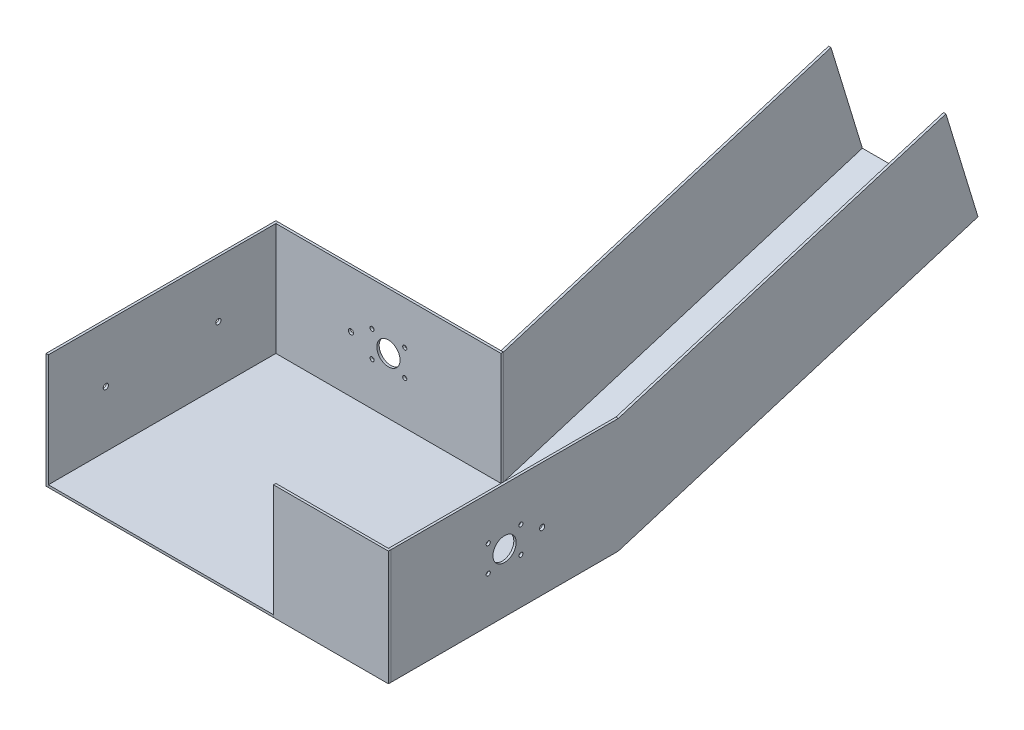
ISO-10303-21;
HEADER;
FILE_DESCRIPTION(('STEP AP214'),'2;1');
FILE_NAME('part.step','',(''),(''),'','','');
FILE_SCHEMA(('AUTOMOTIVE_DESIGN { 1 0 10303 214 1 1 1 1 }'));
ENDSEC;
DATA;
#1=APPLICATION_CONTEXT('core data for automotive mechanical design processes');
#2=APPLICATION_PROTOCOL_DEFINITION('international standard','automotive_design',2000,#1);
#3=PRODUCT_CONTEXT('',#1,'mechanical');
#4=PRODUCT('Part','Part','',(#3));
#5=PRODUCT_RELATED_PRODUCT_CATEGORY('part','',(#4));
#6=PRODUCT_DEFINITION_FORMATION('','',#4);
#7=PRODUCT_DEFINITION_CONTEXT('part definition',#1,'design');
#8=PRODUCT_DEFINITION('design','',#6,#7);
#9=PRODUCT_DEFINITION_SHAPE('','',#8);
#10=(LENGTH_UNIT() NAMED_UNIT(*) SI_UNIT(.MILLI.,.METRE.));
#11=(NAMED_UNIT(*) PLANE_ANGLE_UNIT() SI_UNIT($,.RADIAN.));
#12=(NAMED_UNIT(*) SI_UNIT($,.STERADIAN.) SOLID_ANGLE_UNIT());
#13=UNCERTAINTY_MEASURE_WITH_UNIT(LENGTH_MEASURE(1.E-05),#10,'distance_accuracy_value','');
#14=(GEOMETRIC_REPRESENTATION_CONTEXT(3) GLOBAL_UNCERTAINTY_ASSIGNED_CONTEXT((#13)) GLOBAL_UNIT_ASSIGNED_CONTEXT((#10,
#11,#12)) REPRESENTATION_CONTEXT('',''));
#15=CARTESIAN_POINT('',(0.,0.,0.));
#16=DIRECTION('',(0.,0.,1.));
#17=DIRECTION('',(1.,0.,0.));
#18=AXIS2_PLACEMENT_3D('',#15,#16,#17);
#19=CARTESIAN_POINT('',(-306.35,286.021704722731,-965.098279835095));
#20=DIRECTION('',(0.,-0.291690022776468,0.956512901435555));
#21=DIRECTION('',(0.,-0.956512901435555,-0.291690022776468));
#22=AXIS2_PLACEMENT_3D('',#19,#20,#21);
#23=PLANE('',#22);
#24=DIRECTION('',(0.,-0.956512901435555,-0.291690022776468));
#25=VECTOR('',#24,1.);
#26=CARTESIAN_POINT('',(-300.,286.021704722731,-965.098279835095));
#27=LINE('',#26,#25);
#28=CARTESIAN_POINT('',(-300.,566.30650641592,-879.625015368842));
#29=VERTEX_POINT('',#28);
#30=CARTESIAN_POINT('',(-300.,286.021704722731,-965.098279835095));
#31=VERTEX_POINT('',#30);
#32=EDGE_CURVE('E131',#29,#31,#27,.T.);
#33=ORIENTED_EDGE('',*,*,#32,.T.);
#34=DIRECTION('',(1.,0.,0.));
#35=VECTOR('',#34,1.);
#36=CARTESIAN_POINT('',(-306.35,286.021704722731,-965.098279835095));
#37=LINE('',#36,#35);
#38=CARTESIAN_POINT('',(-306.35,286.021704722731,-965.098279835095));
#39=VERTEX_POINT('',#38);
#40=EDGE_CURVE('E14',#39,#31,#37,.T.);
#41=ORIENTED_EDGE('',*,*,#40,.F.);
#42=DIRECTION('',(0.,-0.956512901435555,-0.291690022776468));
#43=VECTOR('',#42,1.);
#44=CARTESIAN_POINT('',(-306.35,286.021704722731,-965.098279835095));
#45=LINE('',#44,#43);
#46=CARTESIAN_POINT('',(-306.35,566.30650641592,-879.625015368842));
#47=VERTEX_POINT('',#46);
#48=EDGE_CURVE('E119',#47,#39,#45,.T.);
#49=ORIENTED_EDGE('',*,*,#48,.F.);
#50=DIRECTION('',(1.,0.,0.));
#51=VECTOR('',#50,1.);
#52=CARTESIAN_POINT('',(-306.35,566.30650641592,-879.625015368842));
#53=LINE('',#52,#51);
#54=EDGE_CURVE('E127',#47,#29,#53,.T.);
#55=ORIENTED_EDGE('',*,*,#54,.T.);
#56=EDGE_LOOP('',(#33,#41,#49,#55));
#57=FACE_BOUND('',#56,.T.);
#58=ADVANCED_FACE('F68',(#57),#23,.F.);
#59=CARTESIAN_POINT('',(-306.35,286.021704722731,-965.098279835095));
#60=DIRECTION('',(0.,0.956512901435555,0.291690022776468));
#61=DIRECTION('',(0.,-0.291690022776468,0.956512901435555));
#62=AXIS2_PLACEMENT_3D('',#59,#60,#61);
#63=PLANE('',#62);
#64=DIRECTION('',(0.,-0.291690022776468,0.956512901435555));
#65=VECTOR('',#64,1.);
#66=CARTESIAN_POINT('',(-300.,286.021704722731,-965.098279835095));
#67=LINE('',#66,#65);
#68=CARTESIAN_POINT('',(-300.,-6.35000000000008,-6.35000000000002));
#69=VERTEX_POINT('',#68);
#70=EDGE_CURVE('E123',#31,#69,#67,.T.);
#71=ORIENTED_EDGE('',*,*,#70,.T.);
#72=DIRECTION('',(1.,0.,0.));
#73=VECTOR('',#72,1.);
#74=CARTESIAN_POINT('',(-306.35,-6.35000000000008,-6.35000000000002));
#75=LINE('',#74,#73);
#76=CARTESIAN_POINT('',(-306.35,-6.35000000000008,-6.35000000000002));
#77=VERTEX_POINT('',#76);
#78=EDGE_CURVE('E76',#77,#69,#75,.T.);
#79=ORIENTED_EDGE('',*,*,#78,.F.);
#80=DIRECTION('',(0.,-0.291690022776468,0.956512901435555));
#81=VECTOR('',#80,1.);
#82=CARTESIAN_POINT('',(-306.35,286.021704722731,-965.098279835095));
#83=LINE('',#82,#81);
#84=EDGE_CURVE('E114',#39,#77,#83,.T.);
#85=ORIENTED_EDGE('',*,*,#84,.F.);
#86=ORIENTED_EDGE('',*,*,#40,.T.);
#87=EDGE_LOOP('',(#71,#79,#85,#86));
#88=FACE_BOUND('',#87,.T.);
#89=ADVANCED_FACE('F122',(#88),#63,.F.);
#90=CARTESIAN_POINT('',(-306.35,-6.35000000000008,-6.35000000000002));
#91=DIRECTION('',(0.,0.,-1.));
#92=DIRECTION('',(-1.,0.,0.));
#93=AXIS2_PLACEMENT_3D('',#90,#91,#92);
#94=PLANE('',#93);
#95=DIRECTION('',(0.,1.,0.));
#96=VECTOR('',#95,1.);
#97=CARTESIAN_POINT('',(-300.,-6.35000000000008,-6.35000000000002));
#98=LINE('',#97,#96);
#99=CARTESIAN_POINT('',(-300.,300.,-6.35000000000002));
#100=VERTEX_POINT('',#99);
#101=EDGE_CURVE('E101',#69,#100,#98,.T.);
#102=ORIENTED_EDGE('',*,*,#101,.T.);
#103=DIRECTION('',(1.,0.,0.));
#104=VECTOR('',#103,1.);
#105=CARTESIAN_POINT('',(-306.35,300.,-6.35000000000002));
#106=LINE('',#105,#104);
#107=CARTESIAN_POINT('',(-306.35,300.,-6.35000000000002));
#108=VERTEX_POINT('',#107);
#109=EDGE_CURVE('E124',#108,#100,#106,.T.);
#110=ORIENTED_EDGE('',*,*,#109,.F.);
#111=DIRECTION('',(0.,1.,0.));
#112=VECTOR('',#111,1.);
#113=CARTESIAN_POINT('',(-306.35,-6.35000000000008,-6.35000000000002));
#114=LINE('',#113,#112);
#115=EDGE_CURVE('E117',#77,#108,#114,.T.);
#116=ORIENTED_EDGE('',*,*,#115,.F.);
#117=ORIENTED_EDGE('',*,*,#78,.T.);
#118=EDGE_LOOP('',(#102,#110,#116,#117));
#119=FACE_BOUND('',#118,.T.);
#120=ADVANCED_FACE('F125',(#119),#94,.F.);
#121=CARTESIAN_POINT('',(-306.35,300.,-6.35000000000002));
#122=DIRECTION('',(0.,-0.956512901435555,-0.291690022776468));
#123=DIRECTION('',(0.,0.291690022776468,-0.956512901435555));
#124=AXIS2_PLACEMENT_3D('',#121,#122,#123);
#125=PLANE('',#124);
#126=DIRECTION('',(0.,0.291690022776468,-0.956512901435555));
#127=VECTOR('',#126,1.);
#128=CARTESIAN_POINT('',(-300.,300.,-6.35000000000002));
#129=LINE('',#128,#127);
#130=EDGE_CURVE('E107',#100,#29,#129,.T.);
#131=ORIENTED_EDGE('',*,*,#130,.T.);
#132=ORIENTED_EDGE('',*,*,#54,.F.);
#133=DIRECTION('',(0.,0.291690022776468,-0.956512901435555));
#134=VECTOR('',#133,1.);
#135=CARTESIAN_POINT('',(-306.35,300.,-6.35000000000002));
#136=LINE('',#135,#134);
#137=EDGE_CURVE('E84',#108,#47,#136,.T.);
#138=ORIENTED_EDGE('',*,*,#137,.F.);
#139=ORIENTED_EDGE('',*,*,#109,.T.);
#140=EDGE_LOOP('',(#131,#132,#138,#139));
#141=FACE_BOUND('',#140,.T.);
#142=ADVANCED_FACE('F138',(#141),#125,.F.);
#143=CARTESIAN_POINT('',(-306.35,0.,0.));
#144=DIRECTION('',(-1.,0.,0.));
#145=DIRECTION('',(0.,0.,1.));
#146=AXIS2_PLACEMENT_3D('',#143,#144,#145);
#147=PLANE('',#146);
#148=ORIENTED_EDGE('',*,*,#48,.T.);
#149=ORIENTED_EDGE('',*,*,#84,.T.);
#150=ORIENTED_EDGE('',*,*,#115,.T.);
#151=ORIENTED_EDGE('',*,*,#137,.T.);
#152=EDGE_LOOP('',(#148,#149,#150,#151));
#153=FACE_BOUND('',#152,.T.);
#154=ADVANCED_FACE('F115',(#153),#147,.T.);
#155=CARTESIAN_POINT('',(-300.,0.,0.));
#156=DIRECTION('',(-1.,0.,0.));
#157=DIRECTION('',(0.,0.,1.));
#158=AXIS2_PLACEMENT_3D('',#155,#156,#157);
#159=PLANE('',#158);
#160=ORIENTED_EDGE('',*,*,#32,.F.);
#161=ORIENTED_EDGE('',*,*,#130,.F.);
#162=ORIENTED_EDGE('',*,*,#101,.F.);
#163=ORIENTED_EDGE('',*,*,#70,.F.);
#164=EDGE_LOOP('',(#160,#161,#162,#163));
#165=FACE_BOUND('',#164,.T.);
#166=ADVANCED_FACE('F141',(#165),#159,.F.);
#167=CLOSED_SHELL('',(#58,#89,#120,#142,#154,#166));
#168=MANIFOLD_SOLID_BREP('B2',#167);
#169=CARTESIAN_POINT('',(-900.,-6.34999999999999,-6.35));
#170=DIRECTION('',(1.,0.,0.));
#171=DIRECTION('',(0.,0.,-1.));
#172=AXIS2_PLACEMENT_3D('',#169,#170,#171);
#173=PLANE('',#172);
#174=DIRECTION('',(0.,1.,0.));
#175=VECTOR('',#174,1.);
#176=CARTESIAN_POINT('',(-900.,-6.34999999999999,0.));
#177=LINE('',#176,#175);
#178=CARTESIAN_POINT('',(-900.,-6.34999999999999,0.));
#179=VERTEX_POINT('',#178);
#180=CARTESIAN_POINT('',(-900.,300.,0.));
#181=VERTEX_POINT('',#180);
#182=EDGE_CURVE('E265',#179,#181,#177,.T.);
#183=ORIENTED_EDGE('',*,*,#182,.T.);
#184=DIRECTION('',(0.,0.,1.));
#185=VECTOR('',#184,1.);
#186=CARTESIAN_POINT('',(-900.,300.,-6.35));
#187=LINE('',#186,#185);
#188=CARTESIAN_POINT('',(-900.,300.,-6.35));
#189=VERTEX_POINT('',#188);
#190=EDGE_CURVE('E66',#189,#181,#187,.T.);
#191=ORIENTED_EDGE('',*,*,#190,.F.);
#192=DIRECTION('',(0.,1.,0.));
#193=VECTOR('',#192,1.);
#194=CARTESIAN_POINT('',(-900.,-6.34999999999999,-6.35));
#195=LINE('',#194,#193);
#196=CARTESIAN_POINT('',(-900.,-6.34999999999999,-6.35));
#197=VERTEX_POINT('',#196);
#198=EDGE_CURVE('E253',#197,#189,#195,.T.);
#199=ORIENTED_EDGE('',*,*,#198,.F.);
#200=DIRECTION('',(0.,0.,1.));
#201=VECTOR('',#200,1.);
#202=CARTESIAN_POINT('',(-900.,-6.34999999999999,-6.35));
#203=LINE('',#202,#201);
#204=EDGE_CURVE('E261',#197,#179,#203,.T.);
#205=ORIENTED_EDGE('',*,*,#204,.T.);
#206=EDGE_LOOP('',(#183,#191,#199,#205));
#207=FACE_BOUND('',#206,.T.);
#208=ADVANCED_FACE('F202',(#207),#173,.F.);
#209=CARTESIAN_POINT('',(-900.,300.,-6.35));
#210=DIRECTION('',(0.,-1.,0.));
#211=DIRECTION('',(0.,0.,-1.));
#212=AXIS2_PLACEMENT_3D('',#209,#210,#211);
#213=PLANE('',#212);
#214=DIRECTION('',(1.,0.,0.));
#215=VECTOR('',#214,1.);
#216=CARTESIAN_POINT('',(-900.,300.,0.));
#217=LINE('',#216,#215);
#218=CARTESIAN_POINT('',(-300.,300.,0.));
#219=VERTEX_POINT('',#218);
#220=EDGE_CURVE('E257',#181,#219,#217,.T.);
#221=ORIENTED_EDGE('',*,*,#220,.T.);
#222=DIRECTION('',(0.,0.,1.));
#223=VECTOR('',#222,1.);
#224=CARTESIAN_POINT('',(-300.,300.,-6.35));
#225=LINE('',#224,#223);
#226=CARTESIAN_POINT('',(-300.,300.,-6.35));
#227=VERTEX_POINT('',#226);
#228=EDGE_CURVE('E210',#227,#219,#225,.T.);
#229=ORIENTED_EDGE('',*,*,#228,.F.);
#230=DIRECTION('',(1.,0.,0.));
#231=VECTOR('',#230,1.);
#232=CARTESIAN_POINT('',(-900.,300.,-6.35));
#233=LINE('',#232,#231);
#234=EDGE_CURVE('E248',#189,#227,#233,.T.);
#235=ORIENTED_EDGE('',*,*,#234,.F.);
#236=ORIENTED_EDGE('',*,*,#190,.T.);
#237=EDGE_LOOP('',(#221,#229,#235,#236));
#238=FACE_BOUND('',#237,.T.);
#239=ADVANCED_FACE('F256',(#238),#213,.F.);
#240=CARTESIAN_POINT('',(-300.,-6.35000000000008,-6.35));
#241=DIRECTION('',(-1.,0.,0.));
#242=DIRECTION('',(0.,0.,1.));
#243=AXIS2_PLACEMENT_3D('',#240,#241,#242);
#244=PLANE('',#243);
#245=DIRECTION('',(0.,-1.,0.));
#246=VECTOR('',#245,1.);
#247=CARTESIAN_POINT('',(-300.,-6.35000000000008,0.));
#248=LINE('',#247,#246);
#249=CARTESIAN_POINT('',(-300.,-6.35000000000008,0.));
#250=VERTEX_POINT('',#249);
#251=EDGE_CURVE('E235',#219,#250,#248,.T.);
#252=ORIENTED_EDGE('',*,*,#251,.T.);
#253=DIRECTION('',(0.,0.,1.));
#254=VECTOR('',#253,1.);
#255=CARTESIAN_POINT('',(-300.,-6.35000000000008,-6.35));
#256=LINE('',#255,#254);
#257=CARTESIAN_POINT('',(-300.,-6.35000000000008,-6.35));
#258=VERTEX_POINT('',#257);
#259=EDGE_CURVE('E258',#258,#250,#256,.T.);
#260=ORIENTED_EDGE('',*,*,#259,.F.);
#261=DIRECTION('',(0.,-1.,0.));
#262=VECTOR('',#261,1.);
#263=CARTESIAN_POINT('',(-300.,-6.35000000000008,-6.35));
#264=LINE('',#263,#262);
#265=EDGE_CURVE('E251',#227,#258,#264,.T.);
#266=ORIENTED_EDGE('',*,*,#265,.F.);
#267=ORIENTED_EDGE('',*,*,#228,.T.);
#268=EDGE_LOOP('',(#252,#260,#266,#267));
#269=FACE_BOUND('',#268,.T.);
#270=ADVANCED_FACE('F259',(#269),#244,.F.);
#271=CARTESIAN_POINT('',(-900.,-6.34999999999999,-6.35));
#272=DIRECTION('',(0.,1.,0.));
#273=DIRECTION('',(-1.,0.,0.));
#274=AXIS2_PLACEMENT_3D('',#271,#272,#273);
#275=PLANE('',#274);
#276=DIRECTION('',(-1.,0.,0.));
#277=VECTOR('',#276,1.);
#278=CARTESIAN_POINT('',(-900.,-6.34999999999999,0.));
#279=LINE('',#278,#277);
#280=EDGE_CURVE('E241',#250,#179,#279,.T.);
#281=ORIENTED_EDGE('',*,*,#280,.T.);
#282=ORIENTED_EDGE('',*,*,#204,.F.);
#283=DIRECTION('',(-1.,0.,0.));
#284=VECTOR('',#283,1.);
#285=CARTESIAN_POINT('',(-900.,-6.34999999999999,-6.35));
#286=LINE('',#285,#284);
#287=EDGE_CURVE('E218',#258,#197,#286,.T.);
#288=ORIENTED_EDGE('',*,*,#287,.F.);
#289=ORIENTED_EDGE('',*,*,#259,.T.);
#290=EDGE_LOOP('',(#281,#282,#288,#289));
#291=FACE_BOUND('',#290,.T.);
#292=ADVANCED_FACE('F273',(#291),#275,.F.);
#293=CARTESIAN_POINT('',(0.,0.,-6.35));
#294=DIRECTION('',(0.,0.,-1.));
#295=DIRECTION('',(-1.,0.,0.));
#296=AXIS2_PLACEMENT_3D('',#293,#294,#295);
#297=PLANE('',#296);
#298=CARTESIAN_POINT('',(-700.,150.,-6.35));
#299=DIRECTION('',(0.,0.,-1.));
#300=DIRECTION('',(-1.,0.,0.));
#301=AXIS2_PLACEMENT_3D('',#298,#299,#300);
#302=CIRCLE('',#301,7.00000000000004);
#303=CARTESIAN_POINT('',(-693.,150.,-6.35));
#304=VERTEX_POINT('',#303);
#305=EDGE_CURVE('E285',#304,#304,#302,.F.);
#306=ORIENTED_EDGE('',*,*,#305,.T.);
#307=EDGE_LOOP('',(#306));
#308=FACE_BOUND('',#307,.T.);
#309=CARTESIAN_POINT('',(-643.5,115.,-6.35));
#310=DIRECTION('',(0.,0.,-1.));
#311=DIRECTION('',(-1.,0.,0.));
#312=AXIS2_PLACEMENT_3D('',#309,#310,#311);
#313=CIRCLE('',#312,5.50000000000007);
#314=CARTESIAN_POINT('',(-638.,115.,-6.35));
#315=VERTEX_POINT('',#314);
#316=EDGE_CURVE('E291',#315,#315,#313,.F.);
#317=ORIENTED_EDGE('',*,*,#316,.T.);
#318=EDGE_LOOP('',(#317));
#319=FACE_BOUND('',#318,.T.);
#320=CARTESIAN_POINT('',(-556.5,115.,-6.35));
#321=DIRECTION('',(0.,0.,-1.));
#322=DIRECTION('',(-1.,0.,0.));
#323=AXIS2_PLACEMENT_3D('',#320,#321,#322);
#324=CIRCLE('',#323,5.50000000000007);
#325=CARTESIAN_POINT('',(-551.,115.,-6.35));
#326=VERTEX_POINT('',#325);
#327=EDGE_CURVE('E297',#326,#326,#324,.F.);
#328=ORIENTED_EDGE('',*,*,#327,.T.);
#329=EDGE_LOOP('',(#328));
#330=FACE_BOUND('',#329,.T.);
#331=CARTESIAN_POINT('',(-556.5,185.,-6.35));
#332=DIRECTION('',(0.,0.,-1.));
#333=DIRECTION('',(-1.,0.,0.));
#334=AXIS2_PLACEMENT_3D('',#331,#332,#333);
#335=CIRCLE('',#334,5.50000000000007);
#336=CARTESIAN_POINT('',(-551.,185.,-6.35));
#337=VERTEX_POINT('',#336);
#338=EDGE_CURVE('E303',#337,#337,#335,.F.);
#339=ORIENTED_EDGE('',*,*,#338,.T.);
#340=EDGE_LOOP('',(#339));
#341=FACE_BOUND('',#340,.T.);
#342=CARTESIAN_POINT('',(-643.5,185.,-6.35));
#343=DIRECTION('',(0.,0.,-1.));
#344=DIRECTION('',(-1.,0.,0.));
#345=AXIS2_PLACEMENT_3D('',#342,#343,#344);
#346=CIRCLE('',#345,5.50000000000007);
#347=CARTESIAN_POINT('',(-638.,185.,-6.35));
#348=VERTEX_POINT('',#347);
#349=EDGE_CURVE('E309',#348,#348,#346,.F.);
#350=ORIENTED_EDGE('',*,*,#349,.T.);
#351=EDGE_LOOP('',(#350));
#352=FACE_BOUND('',#351,.T.);
#353=CARTESIAN_POINT('',(-600.,150.,-6.35));
#354=DIRECTION('',(0.,0.,-1.));
#355=DIRECTION('',(-1.,0.,0.));
#356=AXIS2_PLACEMENT_3D('',#353,#354,#355);
#357=CIRCLE('',#356,31.0000000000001);
#358=CARTESIAN_POINT('',(-569.,150.,-6.35));
#359=VERTEX_POINT('',#358);
#360=EDGE_CURVE('E279',#359,#359,#357,.F.);
#361=ORIENTED_EDGE('',*,*,#360,.T.);
#362=EDGE_LOOP('',(#361));
#363=FACE_BOUND('',#362,.T.);
#364=ORIENTED_EDGE('',*,*,#198,.T.);
#365=ORIENTED_EDGE('',*,*,#234,.T.);
#366=ORIENTED_EDGE('',*,*,#265,.T.);
#367=ORIENTED_EDGE('',*,*,#287,.T.);
#368=EDGE_LOOP('',(#364,#365,#366,#367));
#369=FACE_BOUND('',#368,.T.);
#370=ADVANCED_FACE('F249',(#308,#319,#330,#341,#352,#363,#369),#297,.T.);
#371=CARTESIAN_POINT('',(0.,0.,0.));
#372=DIRECTION('',(0.,0.,-1.));
#373=DIRECTION('',(-1.,0.,0.));
#374=AXIS2_PLACEMENT_3D('',#371,#372,#373);
#375=PLANE('',#374);
#376=CARTESIAN_POINT('',(-700.,150.,0.));
#377=DIRECTION('',(0.,0.,1.));
#378=DIRECTION('',(1.,0.,0.));
#379=AXIS2_PLACEMENT_3D('',#376,#377,#378);
#380=CIRCLE('',#379,7.00000000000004);
#381=CARTESIAN_POINT('',(-693.,150.,0.));
#382=VERTEX_POINT('',#381);
#383=EDGE_CURVE('E288',#382,#382,#380,.T.);
#384=ORIENTED_EDGE('',*,*,#383,.F.);
#385=EDGE_LOOP('',(#384));
#386=FACE_BOUND('',#385,.T.);
#387=CARTESIAN_POINT('',(-643.5,115.,0.));
#388=DIRECTION('',(0.,0.,1.));
#389=DIRECTION('',(1.,0.,0.));
#390=AXIS2_PLACEMENT_3D('',#387,#388,#389);
#391=CIRCLE('',#390,5.50000000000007);
#392=CARTESIAN_POINT('',(-638.,115.,0.));
#393=VERTEX_POINT('',#392);
#394=EDGE_CURVE('E294',#393,#393,#391,.T.);
#395=ORIENTED_EDGE('',*,*,#394,.F.);
#396=EDGE_LOOP('',(#395));
#397=FACE_BOUND('',#396,.T.);
#398=CARTESIAN_POINT('',(-556.5,115.,0.));
#399=DIRECTION('',(0.,0.,1.));
#400=DIRECTION('',(1.,0.,0.));
#401=AXIS2_PLACEMENT_3D('',#398,#399,#400);
#402=CIRCLE('',#401,5.50000000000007);
#403=CARTESIAN_POINT('',(-551.,115.,0.));
#404=VERTEX_POINT('',#403);
#405=EDGE_CURVE('E300',#404,#404,#402,.T.);
#406=ORIENTED_EDGE('',*,*,#405,.F.);
#407=EDGE_LOOP('',(#406));
#408=FACE_BOUND('',#407,.T.);
#409=CARTESIAN_POINT('',(-556.5,185.,0.));
#410=DIRECTION('',(0.,0.,1.));
#411=DIRECTION('',(1.,0.,0.));
#412=AXIS2_PLACEMENT_3D('',#409,#410,#411);
#413=CIRCLE('',#412,5.50000000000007);
#414=CARTESIAN_POINT('',(-551.,185.,0.));
#415=VERTEX_POINT('',#414);
#416=EDGE_CURVE('E306',#415,#415,#413,.T.);
#417=ORIENTED_EDGE('',*,*,#416,.F.);
#418=EDGE_LOOP('',(#417));
#419=FACE_BOUND('',#418,.T.);
#420=CARTESIAN_POINT('',(-643.5,185.,0.));
#421=DIRECTION('',(0.,0.,1.));
#422=DIRECTION('',(1.,0.,0.));
#423=AXIS2_PLACEMENT_3D('',#420,#421,#422);
#424=CIRCLE('',#423,5.50000000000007);
#425=CARTESIAN_POINT('',(-638.,185.,0.));
#426=VERTEX_POINT('',#425);
#427=EDGE_CURVE('E282',#426,#426,#424,.T.);
#428=ORIENTED_EDGE('',*,*,#427,.F.);
#429=EDGE_LOOP('',(#428));
#430=FACE_BOUND('',#429,.T.);
#431=CARTESIAN_POINT('',(-600.,150.,0.));
#432=DIRECTION('',(0.,0.,1.));
#433=DIRECTION('',(1.,0.,0.));
#434=AXIS2_PLACEMENT_3D('',#431,#432,#433);
#435=CIRCLE('',#434,31.0000000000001);
#436=CARTESIAN_POINT('',(-569.,150.,0.));
#437=VERTEX_POINT('',#436);
#438=EDGE_CURVE('E268',#437,#437,#435,.T.);
#439=ORIENTED_EDGE('',*,*,#438,.F.);
#440=EDGE_LOOP('',(#439));
#441=FACE_BOUND('',#440,.T.);
#442=ORIENTED_EDGE('',*,*,#182,.F.);
#443=ORIENTED_EDGE('',*,*,#280,.F.);
#444=ORIENTED_EDGE('',*,*,#251,.F.);
#445=ORIENTED_EDGE('',*,*,#220,.F.);
#446=EDGE_LOOP('',(#442,#443,#444,#445));
#447=FACE_BOUND('',#446,.T.);
#448=ADVANCED_FACE('F276',(#386,#397,#408,#419,#430,#441,#447),#375,.F.);
#449=CARTESIAN_POINT('',(-600.,150.,-6.351));
#450=DIRECTION('',(0.,0.,1.));
#451=DIRECTION('',(1.,0.,0.));
#452=AXIS2_PLACEMENT_3D('',#449,#450,#451);
#453=CYLINDRICAL_SURFACE('',#452,31.0000000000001);
#454=CARTESIAN_POINT('',(-569.,150.,-6.35));
#455=CARTESIAN_POINT('',(-569.,150.,-6.28385416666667));
#456=CARTESIAN_POINT('',(-569.,150.,-6.21770833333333));
#457=CARTESIAN_POINT('',(-569.,150.,-6.08541666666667));
#458=CARTESIAN_POINT('',(-569.,150.,-6.01927083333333));
#459=CARTESIAN_POINT('',(-569.,150.,-5.88697916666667));
#460=CARTESIAN_POINT('',(-569.,150.,-5.82083333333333));
#461=CARTESIAN_POINT('',(-569.,150.,-5.68854166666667));
#462=CARTESIAN_POINT('',(-569.,150.,-5.62239583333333));
#463=CARTESIAN_POINT('',(-569.,150.,-5.49010416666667));
#464=CARTESIAN_POINT('',(-569.,150.,-5.42395833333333));
#465=CARTESIAN_POINT('',(-569.,150.,-5.29166666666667));
#466=CARTESIAN_POINT('',(-569.,150.,-5.22552083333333));
#467=CARTESIAN_POINT('',(-569.,150.,-5.09322916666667));
#468=CARTESIAN_POINT('',(-569.,150.,-5.02708333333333));
#469=CARTESIAN_POINT('',(-569.,150.,-4.89479166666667));
#470=CARTESIAN_POINT('',(-569.,150.,-4.82864583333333));
#471=CARTESIAN_POINT('',(-569.,150.,-4.69635416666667));
#472=CARTESIAN_POINT('',(-569.,150.,-4.63020833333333));
#473=CARTESIAN_POINT('',(-569.,150.,-4.49791666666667));
#474=CARTESIAN_POINT('',(-569.,150.,-4.43177083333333));
#475=CARTESIAN_POINT('',(-569.,150.,-4.29947916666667));
#476=CARTESIAN_POINT('',(-569.,150.,-4.23333333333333));
#477=CARTESIAN_POINT('',(-569.,150.,-4.10104166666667));
#478=CARTESIAN_POINT('',(-569.,150.,-4.03489583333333));
#479=CARTESIAN_POINT('',(-569.,150.,-3.90260416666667));
#480=CARTESIAN_POINT('',(-569.,150.,-3.83645833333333));
#481=CARTESIAN_POINT('',(-569.,150.,-3.70416666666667));
#482=CARTESIAN_POINT('',(-569.,150.,-3.63802083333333));
#483=CARTESIAN_POINT('',(-569.,150.,-3.50572916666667));
#484=CARTESIAN_POINT('',(-569.,150.,-3.43958333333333));
#485=CARTESIAN_POINT('',(-569.,150.,-3.30729166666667));
#486=CARTESIAN_POINT('',(-569.,150.,-3.24114583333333));
#487=CARTESIAN_POINT('',(-569.,150.,-3.10885416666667));
#488=CARTESIAN_POINT('',(-569.,150.,-3.04270833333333));
#489=CARTESIAN_POINT('',(-569.,150.,-2.91041666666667));
#490=CARTESIAN_POINT('',(-569.,150.,-2.84427083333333));
#491=CARTESIAN_POINT('',(-569.,150.,-2.71197916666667));
#492=CARTESIAN_POINT('',(-569.,150.,-2.64583333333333));
#493=CARTESIAN_POINT('',(-569.,150.,-2.51354166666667));
#494=CARTESIAN_POINT('',(-569.,150.,-2.44739583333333));
#495=CARTESIAN_POINT('',(-569.,150.,-2.31510416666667));
#496=CARTESIAN_POINT('',(-569.,150.,-2.24895833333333));
#497=CARTESIAN_POINT('',(-569.,150.,-2.11666666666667));
#498=CARTESIAN_POINT('',(-569.,150.,-2.05052083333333));
#499=CARTESIAN_POINT('',(-569.,150.,-1.91822916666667));
#500=CARTESIAN_POINT('',(-569.,150.,-1.85208333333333));
#501=CARTESIAN_POINT('',(-569.,150.,-1.71979166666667));
#502=CARTESIAN_POINT('',(-569.,150.,-1.65364583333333));
#503=CARTESIAN_POINT('',(-569.,150.,-1.52135416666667));
#504=CARTESIAN_POINT('',(-569.,150.,-1.45520833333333));
#505=CARTESIAN_POINT('',(-569.,150.,-1.32291666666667));
#506=CARTESIAN_POINT('',(-569.,150.,-1.25677083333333));
#507=CARTESIAN_POINT('',(-569.,150.,-1.12447916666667));
#508=CARTESIAN_POINT('',(-569.,150.,-1.05833333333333));
#509=CARTESIAN_POINT('',(-569.,150.,-0.926041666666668));
#510=CARTESIAN_POINT('',(-569.,150.,-0.859895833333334));
#511=CARTESIAN_POINT('',(-569.,150.,-0.727604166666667));
#512=CARTESIAN_POINT('',(-569.,150.,-0.661458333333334));
#513=CARTESIAN_POINT('',(-569.,150.,-0.529166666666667));
#514=CARTESIAN_POINT('',(-569.,150.,-0.463020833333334));
#515=CARTESIAN_POINT('',(-569.,150.,-0.330729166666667));
#516=CARTESIAN_POINT('',(-569.,150.,-0.264583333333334));
#517=CARTESIAN_POINT('',(-569.,150.,-0.132291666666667));
#518=CARTESIAN_POINT('',(-569.,150.,-0.0661458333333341));
#519=CARTESIAN_POINT('',(-569.,150.,0.));
#520=B_SPLINE_CURVE_WITH_KNOTS('',3,(#454,#455,#456,#457,#458,#459,#460,#461,#462,#463,#464,
#465,#466,#467,#468,#469,#470,#471,#472,#473,#474,#475,#476,#477,#478,#479,#480,#481,#482,#483,
#484,#485,#486,#487,#488,#489,#490,#491,#492,#493,#494,#495,#496,#497,#498,#499,#500,#501,#502,
#503,#504,#505,#506,#507,#508,#509,#510,#511,#512,#513,#514,#515,#516,#517,#518,#519),
.UNSPECIFIED.,.F.,.F.,(4,2,2,2,2,2,2,2,2,2,2,2,2,2,2,2,2,2,2,2,2,2,2,2,2,2,2,2,2,2,2,2,4),(0.,
0.1984375,0.396875,0.595312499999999,0.793749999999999,0.992187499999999,1.190625,1.3890625,
1.5875,1.7859375,1.984375,2.1828125,2.38125,2.5796875,2.778125,2.9765625,3.175,3.3734375,
3.571875,3.7703125,3.96875,4.1671875,4.365625,4.5640625,4.7625,4.9609375,5.159375,5.3578125,
5.55625,5.7546875,5.953125,6.1515625,6.35),.UNSPECIFIED.);
#521=EDGE_CURVE('BSEAM319',#359,#437,#520,.T.);
#522=ORIENTED_EDGE('',*,*,#360,.F.);
#523=ORIENTED_EDGE('',*,*,#438,.T.);
#524=ORIENTED_EDGE('',*,*,#521,.T.);
#525=ORIENTED_EDGE('',*,*,#521,.F.);
#526=EDGE_LOOP('',(#522,#524,#523,#525));
#527=FACE_BOUND('',#526,.T.);
#528=ADVANCED_FACE('F319',(#527),#453,.F.);
#529=CARTESIAN_POINT('',(-643.5,185.,-6.351));
#530=DIRECTION('',(0.,0.,1.));
#531=DIRECTION('',(1.,0.,0.));
#532=AXIS2_PLACEMENT_3D('',#529,#530,#531);
#533=CYLINDRICAL_SURFACE('',#532,5.50000000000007);
#534=CARTESIAN_POINT('',(-638.,185.,-6.35));
#535=CARTESIAN_POINT('',(-638.,185.,-6.28385416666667));
#536=CARTESIAN_POINT('',(-638.,185.,-6.21770833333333));
#537=CARTESIAN_POINT('',(-638.,185.,-6.08541666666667));
#538=CARTESIAN_POINT('',(-638.,185.,-6.01927083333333));
#539=CARTESIAN_POINT('',(-638.,185.,-5.88697916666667));
#540=CARTESIAN_POINT('',(-638.,185.,-5.82083333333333));
#541=CARTESIAN_POINT('',(-638.,185.,-5.68854166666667));
#542=CARTESIAN_POINT('',(-638.,185.,-5.62239583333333));
#543=CARTESIAN_POINT('',(-638.,185.,-5.49010416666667));
#544=CARTESIAN_POINT('',(-638.,185.,-5.42395833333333));
#545=CARTESIAN_POINT('',(-638.,185.,-5.29166666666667));
#546=CARTESIAN_POINT('',(-638.,185.,-5.22552083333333));
#547=CARTESIAN_POINT('',(-638.,185.,-5.09322916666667));
#548=CARTESIAN_POINT('',(-638.,185.,-5.02708333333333));
#549=CARTESIAN_POINT('',(-638.,185.,-4.89479166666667));
#550=CARTESIAN_POINT('',(-638.,185.,-4.82864583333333));
#551=CARTESIAN_POINT('',(-638.,185.,-4.69635416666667));
#552=CARTESIAN_POINT('',(-638.,185.,-4.63020833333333));
#553=CARTESIAN_POINT('',(-638.,185.,-4.49791666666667));
#554=CARTESIAN_POINT('',(-638.,185.,-4.43177083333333));
#555=CARTESIAN_POINT('',(-638.,185.,-4.29947916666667));
#556=CARTESIAN_POINT('',(-638.,185.,-4.23333333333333));
#557=CARTESIAN_POINT('',(-638.,185.,-4.10104166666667));
#558=CARTESIAN_POINT('',(-638.,185.,-4.03489583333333));
#559=CARTESIAN_POINT('',(-638.,185.,-3.90260416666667));
#560=CARTESIAN_POINT('',(-638.,185.,-3.83645833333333));
#561=CARTESIAN_POINT('',(-638.,185.,-3.70416666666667));
#562=CARTESIAN_POINT('',(-638.,185.,-3.63802083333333));
#563=CARTESIAN_POINT('',(-638.,185.,-3.50572916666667));
#564=CARTESIAN_POINT('',(-638.,185.,-3.43958333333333));
#565=CARTESIAN_POINT('',(-638.,185.,-3.30729166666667));
#566=CARTESIAN_POINT('',(-638.,185.,-3.24114583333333));
#567=CARTESIAN_POINT('',(-638.,185.,-3.10885416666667));
#568=CARTESIAN_POINT('',(-638.,185.,-3.04270833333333));
#569=CARTESIAN_POINT('',(-638.,185.,-2.91041666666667));
#570=CARTESIAN_POINT('',(-638.,185.,-2.84427083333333));
#571=CARTESIAN_POINT('',(-638.,185.,-2.71197916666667));
#572=CARTESIAN_POINT('',(-638.,185.,-2.64583333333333));
#573=CARTESIAN_POINT('',(-638.,185.,-2.51354166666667));
#574=CARTESIAN_POINT('',(-638.,185.,-2.44739583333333));
#575=CARTESIAN_POINT('',(-638.,185.,-2.31510416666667));
#576=CARTESIAN_POINT('',(-638.,185.,-2.24895833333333));
#577=CARTESIAN_POINT('',(-638.,185.,-2.11666666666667));
#578=CARTESIAN_POINT('',(-638.,185.,-2.05052083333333));
#579=CARTESIAN_POINT('',(-638.,185.,-1.91822916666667));
#580=CARTESIAN_POINT('',(-638.,185.,-1.85208333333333));
#581=CARTESIAN_POINT('',(-638.,185.,-1.71979166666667));
#582=CARTESIAN_POINT('',(-638.,185.,-1.65364583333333));
#583=CARTESIAN_POINT('',(-638.,185.,-1.52135416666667));
#584=CARTESIAN_POINT('',(-638.,185.,-1.45520833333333));
#585=CARTESIAN_POINT('',(-638.,185.,-1.32291666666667));
#586=CARTESIAN_POINT('',(-638.,185.,-1.25677083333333));
#587=CARTESIAN_POINT('',(-638.,185.,-1.12447916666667));
#588=CARTESIAN_POINT('',(-638.,185.,-1.05833333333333));
#589=CARTESIAN_POINT('',(-638.,185.,-0.926041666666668));
#590=CARTESIAN_POINT('',(-638.,185.,-0.859895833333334));
#591=CARTESIAN_POINT('',(-638.,185.,-0.727604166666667));
#592=CARTESIAN_POINT('',(-638.,185.,-0.661458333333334));
#593=CARTESIAN_POINT('',(-638.,185.,-0.529166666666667));
#594=CARTESIAN_POINT('',(-638.,185.,-0.463020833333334));
#595=CARTESIAN_POINT('',(-638.,185.,-0.330729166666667));
#596=CARTESIAN_POINT('',(-638.,185.,-0.264583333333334));
#597=CARTESIAN_POINT('',(-638.,185.,-0.132291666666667));
#598=CARTESIAN_POINT('',(-638.,185.,-0.0661458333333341));
#599=CARTESIAN_POINT('',(-638.,185.,0.));
#600=B_SPLINE_CURVE_WITH_KNOTS('',3,(#534,#535,#536,#537,#538,#539,#540,#541,#542,#543,#544,
#545,#546,#547,#548,#549,#550,#551,#552,#553,#554,#555,#556,#557,#558,#559,#560,#561,#562,#563,
#564,#565,#566,#567,#568,#569,#570,#571,#572,#573,#574,#575,#576,#577,#578,#579,#580,#581,#582,
#583,#584,#585,#586,#587,#588,#589,#590,#591,#592,#593,#594,#595,#596,#597,#598,#599),
.UNSPECIFIED.,.F.,.F.,(4,2,2,2,2,2,2,2,2,2,2,2,2,2,2,2,2,2,2,2,2,2,2,2,2,2,2,2,2,2,2,2,4),(0.,
0.1984375,0.396875,0.595312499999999,0.793749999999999,0.992187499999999,1.190625,1.3890625,
1.5875,1.7859375,1.984375,2.1828125,2.38125,2.5796875,2.778125,2.9765625,3.175,3.3734375,
3.571875,3.7703125,3.96875,4.1671875,4.365625,4.5640625,4.7625,4.9609375,5.159375,5.3578125,
5.55625,5.7546875,5.953125,6.1515625,6.35),.UNSPECIFIED.);
#601=EDGE_CURVE('BSEAM315',#348,#426,#600,.T.);
#602=ORIENTED_EDGE('',*,*,#349,.F.);
#603=ORIENTED_EDGE('',*,*,#427,.T.);
#604=ORIENTED_EDGE('',*,*,#601,.T.);
#605=ORIENTED_EDGE('',*,*,#601,.F.);
#606=EDGE_LOOP('',(#602,#604,#603,#605));
#607=FACE_BOUND('',#606,.T.);
#608=ADVANCED_FACE('F315',(#607),#533,.F.);
#609=CARTESIAN_POINT('',(-556.5,185.,-6.351));
#610=DIRECTION('',(0.,0.,1.));
#611=DIRECTION('',(1.,0.,0.));
#612=AXIS2_PLACEMENT_3D('',#609,#610,#611);
#613=CYLINDRICAL_SURFACE('',#612,5.50000000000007);
#614=CARTESIAN_POINT('',(-551.,185.,-6.35));
#615=CARTESIAN_POINT('',(-551.,185.,-6.28385416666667));
#616=CARTESIAN_POINT('',(-551.,185.,-6.21770833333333));
#617=CARTESIAN_POINT('',(-551.,185.,-6.08541666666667));
#618=CARTESIAN_POINT('',(-551.,185.,-6.01927083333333));
#619=CARTESIAN_POINT('',(-551.,185.,-5.88697916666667));
#620=CARTESIAN_POINT('',(-551.,185.,-5.82083333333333));
#621=CARTESIAN_POINT('',(-551.,185.,-5.68854166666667));
#622=CARTESIAN_POINT('',(-551.,185.,-5.62239583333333));
#623=CARTESIAN_POINT('',(-551.,185.,-5.49010416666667));
#624=CARTESIAN_POINT('',(-551.,185.,-5.42395833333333));
#625=CARTESIAN_POINT('',(-551.,185.,-5.29166666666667));
#626=CARTESIAN_POINT('',(-551.,185.,-5.22552083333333));
#627=CARTESIAN_POINT('',(-551.,185.,-5.09322916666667));
#628=CARTESIAN_POINT('',(-551.,185.,-5.02708333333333));
#629=CARTESIAN_POINT('',(-551.,185.,-4.89479166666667));
#630=CARTESIAN_POINT('',(-551.,185.,-4.82864583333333));
#631=CARTESIAN_POINT('',(-551.,185.,-4.69635416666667));
#632=CARTESIAN_POINT('',(-551.,185.,-4.63020833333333));
#633=CARTESIAN_POINT('',(-551.,185.,-4.49791666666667));
#634=CARTESIAN_POINT('',(-551.,185.,-4.43177083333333));
#635=CARTESIAN_POINT('',(-551.,185.,-4.29947916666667));
#636=CARTESIAN_POINT('',(-551.,185.,-4.23333333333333));
#637=CARTESIAN_POINT('',(-551.,185.,-4.10104166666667));
#638=CARTESIAN_POINT('',(-551.,185.,-4.03489583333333));
#639=CARTESIAN_POINT('',(-551.,185.,-3.90260416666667));
#640=CARTESIAN_POINT('',(-551.,185.,-3.83645833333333));
#641=CARTESIAN_POINT('',(-551.,185.,-3.70416666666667));
#642=CARTESIAN_POINT('',(-551.,185.,-3.63802083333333));
#643=CARTESIAN_POINT('',(-551.,185.,-3.50572916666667));
#644=CARTESIAN_POINT('',(-551.,185.,-3.43958333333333));
#645=CARTESIAN_POINT('',(-551.,185.,-3.30729166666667));
#646=CARTESIAN_POINT('',(-551.,185.,-3.24114583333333));
#647=CARTESIAN_POINT('',(-551.,185.,-3.10885416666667));
#648=CARTESIAN_POINT('',(-551.,185.,-3.04270833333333));
#649=CARTESIAN_POINT('',(-551.,185.,-2.91041666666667));
#650=CARTESIAN_POINT('',(-551.,185.,-2.84427083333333));
#651=CARTESIAN_POINT('',(-551.,185.,-2.71197916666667));
#652=CARTESIAN_POINT('',(-551.,185.,-2.64583333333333));
#653=CARTESIAN_POINT('',(-551.,185.,-2.51354166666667));
#654=CARTESIAN_POINT('',(-551.,185.,-2.44739583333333));
#655=CARTESIAN_POINT('',(-551.,185.,-2.31510416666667));
#656=CARTESIAN_POINT('',(-551.,185.,-2.24895833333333));
#657=CARTESIAN_POINT('',(-551.,185.,-2.11666666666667));
#658=CARTESIAN_POINT('',(-551.,185.,-2.05052083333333));
#659=CARTESIAN_POINT('',(-551.,185.,-1.91822916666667));
#660=CARTESIAN_POINT('',(-551.,185.,-1.85208333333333));
#661=CARTESIAN_POINT('',(-551.,185.,-1.71979166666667));
#662=CARTESIAN_POINT('',(-551.,185.,-1.65364583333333));
#663=CARTESIAN_POINT('',(-551.,185.,-1.52135416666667));
#664=CARTESIAN_POINT('',(-551.,185.,-1.45520833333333));
#665=CARTESIAN_POINT('',(-551.,185.,-1.32291666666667));
#666=CARTESIAN_POINT('',(-551.,185.,-1.25677083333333));
#667=CARTESIAN_POINT('',(-551.,185.,-1.12447916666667));
#668=CARTESIAN_POINT('',(-551.,185.,-1.05833333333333));
#669=CARTESIAN_POINT('',(-551.,185.,-0.926041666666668));
#670=CARTESIAN_POINT('',(-551.,185.,-0.859895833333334));
#671=CARTESIAN_POINT('',(-551.,185.,-0.727604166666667));
#672=CARTESIAN_POINT('',(-551.,185.,-0.661458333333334));
#673=CARTESIAN_POINT('',(-551.,185.,-0.529166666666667));
#674=CARTESIAN_POINT('',(-551.,185.,-0.463020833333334));
#675=CARTESIAN_POINT('',(-551.,185.,-0.330729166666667));
#676=CARTESIAN_POINT('',(-551.,185.,-0.264583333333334));
#677=CARTESIAN_POINT('',(-551.,185.,-0.132291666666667));
#678=CARTESIAN_POINT('',(-551.,185.,-0.0661458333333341));
#679=CARTESIAN_POINT('',(-551.,185.,0.));
#680=B_SPLINE_CURVE_WITH_KNOTS('',3,(#614,#615,#616,#617,#618,#619,#620,#621,#622,#623,#624,
#625,#626,#627,#628,#629,#630,#631,#632,#633,#634,#635,#636,#637,#638,#639,#640,#641,#642,#643,
#644,#645,#646,#647,#648,#649,#650,#651,#652,#653,#654,#655,#656,#657,#658,#659,#660,#661,#662,
#663,#664,#665,#666,#667,#668,#669,#670,#671,#672,#673,#674,#675,#676,#677,#678,#679),
.UNSPECIFIED.,.F.,.F.,(4,2,2,2,2,2,2,2,2,2,2,2,2,2,2,2,2,2,2,2,2,2,2,2,2,2,2,2,2,2,2,2,4),(0.,
0.1984375,0.396875,0.595312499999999,0.793749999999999,0.992187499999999,1.190625,1.3890625,
1.5875,1.7859375,1.984375,2.1828125,2.38125,2.5796875,2.778125,2.9765625,3.175,3.3734375,
3.571875,3.7703125,3.96875,4.1671875,4.365625,4.5640625,4.7625,4.9609375,5.159375,5.3578125,
5.55625,5.7546875,5.953125,6.1515625,6.35),.UNSPECIFIED.);
#681=EDGE_CURVE('BSEAM330',#337,#415,#680,.T.);
#682=ORIENTED_EDGE('',*,*,#338,.F.);
#683=ORIENTED_EDGE('',*,*,#416,.T.);
#684=ORIENTED_EDGE('',*,*,#681,.T.);
#685=ORIENTED_EDGE('',*,*,#681,.F.);
#686=EDGE_LOOP('',(#682,#684,#683,#685));
#687=FACE_BOUND('',#686,.T.);
#688=ADVANCED_FACE('F330',(#687),#613,.F.);
#689=CARTESIAN_POINT('',(-556.5,115.,-6.351));
#690=DIRECTION('',(0.,0.,1.));
#691=DIRECTION('',(1.,0.,0.));
#692=AXIS2_PLACEMENT_3D('',#689,#690,#691);
#693=CYLINDRICAL_SURFACE('',#692,5.50000000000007);
#694=CARTESIAN_POINT('',(-551.,115.,-6.35));
#695=CARTESIAN_POINT('',(-551.,115.,-6.28385416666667));
#696=CARTESIAN_POINT('',(-551.,115.,-6.21770833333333));
#697=CARTESIAN_POINT('',(-551.,115.,-6.08541666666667));
#698=CARTESIAN_POINT('',(-551.,115.,-6.01927083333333));
#699=CARTESIAN_POINT('',(-551.,115.,-5.88697916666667));
#700=CARTESIAN_POINT('',(-551.,115.,-5.82083333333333));
#701=CARTESIAN_POINT('',(-551.,115.,-5.68854166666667));
#702=CARTESIAN_POINT('',(-551.,115.,-5.62239583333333));
#703=CARTESIAN_POINT('',(-551.,115.,-5.49010416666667));
#704=CARTESIAN_POINT('',(-551.,115.,-5.42395833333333));
#705=CARTESIAN_POINT('',(-551.,115.,-5.29166666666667));
#706=CARTESIAN_POINT('',(-551.,115.,-5.22552083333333));
#707=CARTESIAN_POINT('',(-551.,115.,-5.09322916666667));
#708=CARTESIAN_POINT('',(-551.,115.,-5.02708333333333));
#709=CARTESIAN_POINT('',(-551.,115.,-4.89479166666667));
#710=CARTESIAN_POINT('',(-551.,115.,-4.82864583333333));
#711=CARTESIAN_POINT('',(-551.,115.,-4.69635416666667));
#712=CARTESIAN_POINT('',(-551.,115.,-4.63020833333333));
#713=CARTESIAN_POINT('',(-551.,115.,-4.49791666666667));
#714=CARTESIAN_POINT('',(-551.,115.,-4.43177083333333));
#715=CARTESIAN_POINT('',(-551.,115.,-4.29947916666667));
#716=CARTESIAN_POINT('',(-551.,115.,-4.23333333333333));
#717=CARTESIAN_POINT('',(-551.,115.,-4.10104166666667));
#718=CARTESIAN_POINT('',(-551.,115.,-4.03489583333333));
#719=CARTESIAN_POINT('',(-551.,115.,-3.90260416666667));
#720=CARTESIAN_POINT('',(-551.,115.,-3.83645833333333));
#721=CARTESIAN_POINT('',(-551.,115.,-3.70416666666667));
#722=CARTESIAN_POINT('',(-551.,115.,-3.63802083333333));
#723=CARTESIAN_POINT('',(-551.,115.,-3.50572916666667));
#724=CARTESIAN_POINT('',(-551.,115.,-3.43958333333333));
#725=CARTESIAN_POINT('',(-551.,115.,-3.30729166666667));
#726=CARTESIAN_POINT('',(-551.,115.,-3.24114583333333));
#727=CARTESIAN_POINT('',(-551.,115.,-3.10885416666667));
#728=CARTESIAN_POINT('',(-551.,115.,-3.04270833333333));
#729=CARTESIAN_POINT('',(-551.,115.,-2.91041666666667));
#730=CARTESIAN_POINT('',(-551.,115.,-2.84427083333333));
#731=CARTESIAN_POINT('',(-551.,115.,-2.71197916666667));
#732=CARTESIAN_POINT('',(-551.,115.,-2.64583333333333));
#733=CARTESIAN_POINT('',(-551.,115.,-2.51354166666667));
#734=CARTESIAN_POINT('',(-551.,115.,-2.44739583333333));
#735=CARTESIAN_POINT('',(-551.,115.,-2.31510416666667));
#736=CARTESIAN_POINT('',(-551.,115.,-2.24895833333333));
#737=CARTESIAN_POINT('',(-551.,115.,-2.11666666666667));
#738=CARTESIAN_POINT('',(-551.,115.,-2.05052083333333));
#739=CARTESIAN_POINT('',(-551.,115.,-1.91822916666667));
#740=CARTESIAN_POINT('',(-551.,115.,-1.85208333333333));
#741=CARTESIAN_POINT('',(-551.,115.,-1.71979166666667));
#742=CARTESIAN_POINT('',(-551.,115.,-1.65364583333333));
#743=CARTESIAN_POINT('',(-551.,115.,-1.52135416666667));
#744=CARTESIAN_POINT('',(-551.,115.,-1.45520833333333));
#745=CARTESIAN_POINT('',(-551.,115.,-1.32291666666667));
#746=CARTESIAN_POINT('',(-551.,115.,-1.25677083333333));
#747=CARTESIAN_POINT('',(-551.,115.,-1.12447916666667));
#748=CARTESIAN_POINT('',(-551.,115.,-1.05833333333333));
#749=CARTESIAN_POINT('',(-551.,115.,-0.926041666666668));
#750=CARTESIAN_POINT('',(-551.,115.,-0.859895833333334));
#751=CARTESIAN_POINT('',(-551.,115.,-0.727604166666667));
#752=CARTESIAN_POINT('',(-551.,115.,-0.661458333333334));
#753=CARTESIAN_POINT('',(-551.,115.,-0.529166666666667));
#754=CARTESIAN_POINT('',(-551.,115.,-0.463020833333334));
#755=CARTESIAN_POINT('',(-551.,115.,-0.330729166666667));
#756=CARTESIAN_POINT('',(-551.,115.,-0.264583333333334));
#757=CARTESIAN_POINT('',(-551.,115.,-0.132291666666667));
#758=CARTESIAN_POINT('',(-551.,115.,-0.0661458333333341));
#759=CARTESIAN_POINT('',(-551.,115.,0.));
#760=B_SPLINE_CURVE_WITH_KNOTS('',3,(#694,#695,#696,#697,#698,#699,#700,#701,#702,#703,#704,
#705,#706,#707,#708,#709,#710,#711,#712,#713,#714,#715,#716,#717,#718,#719,#720,#721,#722,#723,
#724,#725,#726,#727,#728,#729,#730,#731,#732,#733,#734,#735,#736,#737,#738,#739,#740,#741,#742,
#743,#744,#745,#746,#747,#748,#749,#750,#751,#752,#753,#754,#755,#756,#757,#758,#759),
.UNSPECIFIED.,.F.,.F.,(4,2,2,2,2,2,2,2,2,2,2,2,2,2,2,2,2,2,2,2,2,2,2,2,2,2,2,2,2,2,2,2,4),(0.,
0.1984375,0.396875,0.595312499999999,0.793749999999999,0.992187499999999,1.190625,1.3890625,
1.5875,1.7859375,1.984375,2.1828125,2.38125,2.5796875,2.778125,2.9765625,3.175,3.3734375,
3.571875,3.7703125,3.96875,4.1671875,4.365625,4.5640625,4.7625,4.9609375,5.159375,5.3578125,
5.55625,5.7546875,5.953125,6.1515625,6.35),.UNSPECIFIED.);
#761=EDGE_CURVE('BSEAM363',#326,#404,#760,.T.);
#762=ORIENTED_EDGE('',*,*,#327,.F.);
#763=ORIENTED_EDGE('',*,*,#405,.T.);
#764=ORIENTED_EDGE('',*,*,#761,.T.);
#765=ORIENTED_EDGE('',*,*,#761,.F.);
#766=EDGE_LOOP('',(#762,#764,#763,#765));
#767=FACE_BOUND('',#766,.T.);
#768=ADVANCED_FACE('F363',(#767),#693,.F.);
#769=CARTESIAN_POINT('',(-643.5,115.,-6.351));
#770=DIRECTION('',(0.,0.,1.));
#771=DIRECTION('',(1.,0.,0.));
#772=AXIS2_PLACEMENT_3D('',#769,#770,#771);
#773=CYLINDRICAL_SURFACE('',#772,5.50000000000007);
#774=CARTESIAN_POINT('',(-638.,115.,-6.35));
#775=CARTESIAN_POINT('',(-638.,115.,-6.28385416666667));
#776=CARTESIAN_POINT('',(-638.,115.,-6.21770833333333));
#777=CARTESIAN_POINT('',(-638.,115.,-6.08541666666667));
#778=CARTESIAN_POINT('',(-638.,115.,-6.01927083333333));
#779=CARTESIAN_POINT('',(-638.,115.,-5.88697916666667));
#780=CARTESIAN_POINT('',(-638.,115.,-5.82083333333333));
#781=CARTESIAN_POINT('',(-638.,115.,-5.68854166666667));
#782=CARTESIAN_POINT('',(-638.,115.,-5.62239583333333));
#783=CARTESIAN_POINT('',(-638.,115.,-5.49010416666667));
#784=CARTESIAN_POINT('',(-638.,115.,-5.42395833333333));
#785=CARTESIAN_POINT('',(-638.,115.,-5.29166666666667));
#786=CARTESIAN_POINT('',(-638.,115.,-5.22552083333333));
#787=CARTESIAN_POINT('',(-638.,115.,-5.09322916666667));
#788=CARTESIAN_POINT('',(-638.,115.,-5.02708333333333));
#789=CARTESIAN_POINT('',(-638.,115.,-4.89479166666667));
#790=CARTESIAN_POINT('',(-638.,115.,-4.82864583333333));
#791=CARTESIAN_POINT('',(-638.,115.,-4.69635416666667));
#792=CARTESIAN_POINT('',(-638.,115.,-4.63020833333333));
#793=CARTESIAN_POINT('',(-638.,115.,-4.49791666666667));
#794=CARTESIAN_POINT('',(-638.,115.,-4.43177083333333));
#795=CARTESIAN_POINT('',(-638.,115.,-4.29947916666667));
#796=CARTESIAN_POINT('',(-638.,115.,-4.23333333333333));
#797=CARTESIAN_POINT('',(-638.,115.,-4.10104166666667));
#798=CARTESIAN_POINT('',(-638.,115.,-4.03489583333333));
#799=CARTESIAN_POINT('',(-638.,115.,-3.90260416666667));
#800=CARTESIAN_POINT('',(-638.,115.,-3.83645833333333));
#801=CARTESIAN_POINT('',(-638.,115.,-3.70416666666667));
#802=CARTESIAN_POINT('',(-638.,115.,-3.63802083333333));
#803=CARTESIAN_POINT('',(-638.,115.,-3.50572916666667));
#804=CARTESIAN_POINT('',(-638.,115.,-3.43958333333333));
#805=CARTESIAN_POINT('',(-638.,115.,-3.30729166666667));
#806=CARTESIAN_POINT('',(-638.,115.,-3.24114583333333));
#807=CARTESIAN_POINT('',(-638.,115.,-3.10885416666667));
#808=CARTESIAN_POINT('',(-638.,115.,-3.04270833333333));
#809=CARTESIAN_POINT('',(-638.,115.,-2.91041666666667));
#810=CARTESIAN_POINT('',(-638.,115.,-2.84427083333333));
#811=CARTESIAN_POINT('',(-638.,115.,-2.71197916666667));
#812=CARTESIAN_POINT('',(-638.,115.,-2.64583333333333));
#813=CARTESIAN_POINT('',(-638.,115.,-2.51354166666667));
#814=CARTESIAN_POINT('',(-638.,115.,-2.44739583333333));
#815=CARTESIAN_POINT('',(-638.,115.,-2.31510416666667));
#816=CARTESIAN_POINT('',(-638.,115.,-2.24895833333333));
#817=CARTESIAN_POINT('',(-638.,115.,-2.11666666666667));
#818=CARTESIAN_POINT('',(-638.,115.,-2.05052083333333));
#819=CARTESIAN_POINT('',(-638.,115.,-1.91822916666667));
#820=CARTESIAN_POINT('',(-638.,115.,-1.85208333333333));
#821=CARTESIAN_POINT('',(-638.,115.,-1.71979166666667));
#822=CARTESIAN_POINT('',(-638.,115.,-1.65364583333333));
#823=CARTESIAN_POINT('',(-638.,115.,-1.52135416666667));
#824=CARTESIAN_POINT('',(-638.,115.,-1.45520833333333));
#825=CARTESIAN_POINT('',(-638.,115.,-1.32291666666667));
#826=CARTESIAN_POINT('',(-638.,115.,-1.25677083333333));
#827=CARTESIAN_POINT('',(-638.,115.,-1.12447916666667));
#828=CARTESIAN_POINT('',(-638.,115.,-1.05833333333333));
#829=CARTESIAN_POINT('',(-638.,115.,-0.926041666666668));
#830=CARTESIAN_POINT('',(-638.,115.,-0.859895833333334));
#831=CARTESIAN_POINT('',(-638.,115.,-0.727604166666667));
#832=CARTESIAN_POINT('',(-638.,115.,-0.661458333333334));
#833=CARTESIAN_POINT('',(-638.,115.,-0.529166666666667));
#834=CARTESIAN_POINT('',(-638.,115.,-0.463020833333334));
#835=CARTESIAN_POINT('',(-638.,115.,-0.330729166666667));
#836=CARTESIAN_POINT('',(-638.,115.,-0.264583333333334));
#837=CARTESIAN_POINT('',(-638.,115.,-0.132291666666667));
#838=CARTESIAN_POINT('',(-638.,115.,-0.0661458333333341));
#839=CARTESIAN_POINT('',(-638.,115.,0.));
#840=B_SPLINE_CURVE_WITH_KNOTS('',3,(#774,#775,#776,#777,#778,#779,#780,#781,#782,#783,#784,
#785,#786,#787,#788,#789,#790,#791,#792,#793,#794,#795,#796,#797,#798,#799,#800,#801,#802,#803,
#804,#805,#806,#807,#808,#809,#810,#811,#812,#813,#814,#815,#816,#817,#818,#819,#820,#821,#822,
#823,#824,#825,#826,#827,#828,#829,#830,#831,#832,#833,#834,#835,#836,#837,#838,#839),
.UNSPECIFIED.,.F.,.F.,(4,2,2,2,2,2,2,2,2,2,2,2,2,2,2,2,2,2,2,2,2,2,2,2,2,2,2,2,2,2,2,2,4),(0.,
0.1984375,0.396875,0.595312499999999,0.793749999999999,0.992187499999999,1.190625,1.3890625,
1.5875,1.7859375,1.984375,2.1828125,2.38125,2.5796875,2.778125,2.9765625,3.175,3.3734375,
3.571875,3.7703125,3.96875,4.1671875,4.365625,4.5640625,4.7625,4.9609375,5.159375,5.3578125,
5.55625,5.7546875,5.953125,6.1515625,6.35),.UNSPECIFIED.);
#841=EDGE_CURVE('BSEAM370',#315,#393,#840,.T.);
#842=ORIENTED_EDGE('',*,*,#316,.F.);
#843=ORIENTED_EDGE('',*,*,#394,.T.);
#844=ORIENTED_EDGE('',*,*,#841,.T.);
#845=ORIENTED_EDGE('',*,*,#841,.F.);
#846=EDGE_LOOP('',(#842,#844,#843,#845));
#847=FACE_BOUND('',#846,.T.);
#848=ADVANCED_FACE('F370',(#847),#773,.F.);
#849=CARTESIAN_POINT('',(-700.,150.,-6.351));
#850=DIRECTION('',(0.,0.,1.));
#851=DIRECTION('',(1.,0.,0.));
#852=AXIS2_PLACEMENT_3D('',#849,#850,#851);
#853=CYLINDRICAL_SURFACE('',#852,7.00000000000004);
#854=CARTESIAN_POINT('',(-693.,150.,-6.35));
#855=CARTESIAN_POINT('',(-693.,150.,-6.28385416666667));
#856=CARTESIAN_POINT('',(-693.,150.,-6.21770833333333));
#857=CARTESIAN_POINT('',(-693.,150.,-6.08541666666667));
#858=CARTESIAN_POINT('',(-693.,150.,-6.01927083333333));
#859=CARTESIAN_POINT('',(-693.,150.,-5.88697916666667));
#860=CARTESIAN_POINT('',(-693.,150.,-5.82083333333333));
#861=CARTESIAN_POINT('',(-693.,150.,-5.68854166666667));
#862=CARTESIAN_POINT('',(-693.,150.,-5.62239583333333));
#863=CARTESIAN_POINT('',(-693.,150.,-5.49010416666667));
#864=CARTESIAN_POINT('',(-693.,150.,-5.42395833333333));
#865=CARTESIAN_POINT('',(-693.,150.,-5.29166666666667));
#866=CARTESIAN_POINT('',(-693.,150.,-5.22552083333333));
#867=CARTESIAN_POINT('',(-693.,150.,-5.09322916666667));
#868=CARTESIAN_POINT('',(-693.,150.,-5.02708333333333));
#869=CARTESIAN_POINT('',(-693.,150.,-4.89479166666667));
#870=CARTESIAN_POINT('',(-693.,150.,-4.82864583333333));
#871=CARTESIAN_POINT('',(-693.,150.,-4.69635416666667));
#872=CARTESIAN_POINT('',(-693.,150.,-4.63020833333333));
#873=CARTESIAN_POINT('',(-693.,150.,-4.49791666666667));
#874=CARTESIAN_POINT('',(-693.,150.,-4.43177083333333));
#875=CARTESIAN_POINT('',(-693.,150.,-4.29947916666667));
#876=CARTESIAN_POINT('',(-693.,150.,-4.23333333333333));
#877=CARTESIAN_POINT('',(-693.,150.,-4.10104166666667));
#878=CARTESIAN_POINT('',(-693.,150.,-4.03489583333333));
#879=CARTESIAN_POINT('',(-693.,150.,-3.90260416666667));
#880=CARTESIAN_POINT('',(-693.,150.,-3.83645833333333));
#881=CARTESIAN_POINT('',(-693.,150.,-3.70416666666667));
#882=CARTESIAN_POINT('',(-693.,150.,-3.63802083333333));
#883=CARTESIAN_POINT('',(-693.,150.,-3.50572916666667));
#884=CARTESIAN_POINT('',(-693.,150.,-3.43958333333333));
#885=CARTESIAN_POINT('',(-693.,150.,-3.30729166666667));
#886=CARTESIAN_POINT('',(-693.,150.,-3.24114583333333));
#887=CARTESIAN_POINT('',(-693.,150.,-3.10885416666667));
#888=CARTESIAN_POINT('',(-693.,150.,-3.04270833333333));
#889=CARTESIAN_POINT('',(-693.,150.,-2.91041666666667));
#890=CARTESIAN_POINT('',(-693.,150.,-2.84427083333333));
#891=CARTESIAN_POINT('',(-693.,150.,-2.71197916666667));
#892=CARTESIAN_POINT('',(-693.,150.,-2.64583333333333));
#893=CARTESIAN_POINT('',(-693.,150.,-2.51354166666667));
#894=CARTESIAN_POINT('',(-693.,150.,-2.44739583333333));
#895=CARTESIAN_POINT('',(-693.,150.,-2.31510416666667));
#896=CARTESIAN_POINT('',(-693.,150.,-2.24895833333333));
#897=CARTESIAN_POINT('',(-693.,150.,-2.11666666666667));
#898=CARTESIAN_POINT('',(-693.,150.,-2.05052083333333));
#899=CARTESIAN_POINT('',(-693.,150.,-1.91822916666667));
#900=CARTESIAN_POINT('',(-693.,150.,-1.85208333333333));
#901=CARTESIAN_POINT('',(-693.,150.,-1.71979166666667));
#902=CARTESIAN_POINT('',(-693.,150.,-1.65364583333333));
#903=CARTESIAN_POINT('',(-693.,150.,-1.52135416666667));
#904=CARTESIAN_POINT('',(-693.,150.,-1.45520833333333));
#905=CARTESIAN_POINT('',(-693.,150.,-1.32291666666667));
#906=CARTESIAN_POINT('',(-693.,150.,-1.25677083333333));
#907=CARTESIAN_POINT('',(-693.,150.,-1.12447916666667));
#908=CARTESIAN_POINT('',(-693.,150.,-1.05833333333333));
#909=CARTESIAN_POINT('',(-693.,150.,-0.926041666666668));
#910=CARTESIAN_POINT('',(-693.,150.,-0.859895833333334));
#911=CARTESIAN_POINT('',(-693.,150.,-0.727604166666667));
#912=CARTESIAN_POINT('',(-693.,150.,-0.661458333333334));
#913=CARTESIAN_POINT('',(-693.,150.,-0.529166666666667));
#914=CARTESIAN_POINT('',(-693.,150.,-0.463020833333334));
#915=CARTESIAN_POINT('',(-693.,150.,-0.330729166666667));
#916=CARTESIAN_POINT('',(-693.,150.,-0.264583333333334));
#917=CARTESIAN_POINT('',(-693.,150.,-0.132291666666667));
#918=CARTESIAN_POINT('',(-693.,150.,-0.0661458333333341));
#919=CARTESIAN_POINT('',(-693.,150.,0.));
#920=B_SPLINE_CURVE_WITH_KNOTS('',3,(#854,#855,#856,#857,#858,#859,#860,#861,#862,#863,#864,
#865,#866,#867,#868,#869,#870,#871,#872,#873,#874,#875,#876,#877,#878,#879,#880,#881,#882,#883,
#884,#885,#886,#887,#888,#889,#890,#891,#892,#893,#894,#895,#896,#897,#898,#899,#900,#901,#902,
#903,#904,#905,#906,#907,#908,#909,#910,#911,#912,#913,#914,#915,#916,#917,#918,#919),
.UNSPECIFIED.,.F.,.F.,(4,2,2,2,2,2,2,2,2,2,2,2,2,2,2,2,2,2,2,2,2,2,2,2,2,2,2,2,2,2,2,2,4),(0.,
0.1984375,0.396875,0.595312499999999,0.793749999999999,0.992187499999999,1.190625,1.3890625,
1.5875,1.7859375,1.984375,2.1828125,2.38125,2.5796875,2.778125,2.9765625,3.175,3.3734375,
3.571875,3.7703125,3.96875,4.1671875,4.365625,4.5640625,4.7625,4.9609375,5.159375,5.3578125,
5.55625,5.7546875,5.953125,6.1515625,6.35),.UNSPECIFIED.);
#921=EDGE_CURVE('BSEAM375',#304,#382,#920,.T.);
#922=ORIENTED_EDGE('',*,*,#305,.F.);
#923=ORIENTED_EDGE('',*,*,#383,.T.);
#924=ORIENTED_EDGE('',*,*,#921,.T.);
#925=ORIENTED_EDGE('',*,*,#921,.F.);
#926=EDGE_LOOP('',(#922,#924,#923,#925));
#927=FACE_BOUND('',#926,.T.);
#928=ADVANCED_FACE('F375',(#927),#853,.F.);
#929=CLOSED_SHELL('',(#208,#239,#270,#292,#370,#448,#528,#608,#688,#768,#848,#928));
#930=MANIFOLD_SOLID_BREP('B8',#929);
#931=CARTESIAN_POINT('',(-906.35,300.,606.35));
#932=DIRECTION('',(0.,0.,-1.));
#933=DIRECTION('',(-1.,0.,0.));
#934=AXIS2_PLACEMENT_3D('',#931,#932,#933);
#935=PLANE('',#934);
#936=DIRECTION('',(0.,1.,0.));
#937=VECTOR('',#936,1.);
#938=CARTESIAN_POINT('',(-900.,300.,606.35));
#939=LINE('',#938,#937);
#940=CARTESIAN_POINT('',(-900.,-6.34999999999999,606.35));
#941=VERTEX_POINT('',#940);
#942=CARTESIAN_POINT('',(-900.,300.,606.35));
#943=VERTEX_POINT('',#942);
#944=EDGE_CURVE('E513',#941,#943,#939,.T.);
#945=ORIENTED_EDGE('',*,*,#944,.T.);
#946=DIRECTION('',(1.,0.,0.));
#947=VECTOR('',#946,1.);
#948=CARTESIAN_POINT('',(-906.35,300.,606.35));
#949=LINE('',#948,#947);
#950=CARTESIAN_POINT('',(-906.35,300.,606.35));
#951=VERTEX_POINT('',#950);
#952=EDGE_CURVE('E200',#951,#943,#949,.T.);
#953=ORIENTED_EDGE('',*,*,#952,.F.);
#954=DIRECTION('',(0.,1.,0.));
#955=VECTOR('',#954,1.);
#956=CARTESIAN_POINT('',(-906.35,300.,606.35));
#957=LINE('',#956,#955);
#958=CARTESIAN_POINT('',(-906.35,-6.34999999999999,606.35));
#959=VERTEX_POINT('',#958);
#960=EDGE_CURVE('E501',#959,#951,#957,.T.);
#961=ORIENTED_EDGE('',*,*,#960,.F.);
#962=DIRECTION('',(1.,0.,0.));
#963=VECTOR('',#962,1.);
#964=CARTESIAN_POINT('',(-906.35,-6.34999999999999,606.35));
#965=LINE('',#964,#963);
#966=EDGE_CURVE('E509',#959,#941,#965,.T.);
#967=ORIENTED_EDGE('',*,*,#966,.T.);
#968=EDGE_LOOP('',(#945,#953,#961,#967));
#969=FACE_BOUND('',#968,.T.);
#970=ADVANCED_FACE('F450',(#969),#935,.F.);
#971=CARTESIAN_POINT('',(-906.35,300.,606.35));
#972=DIRECTION('',(0.,-1.,0.));
#973=DIRECTION('',(0.,0.,-1.));
#974=AXIS2_PLACEMENT_3D('',#971,#972,#973);
#975=PLANE('',#974);
#976=DIRECTION('',(0.,0.,-1.));
#977=VECTOR('',#976,1.);
#978=CARTESIAN_POINT('',(-900.,300.,606.35));
#979=LINE('',#978,#977);
#980=CARTESIAN_POINT('',(-900.,300.,-6.34999999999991));
#981=VERTEX_POINT('',#980);
#982=EDGE_CURVE('E505',#943,#981,#979,.T.);
#983=ORIENTED_EDGE('',*,*,#982,.T.);
#984=DIRECTION('',(1.,0.,0.));
#985=VECTOR('',#984,1.);
#986=CARTESIAN_POINT('',(-906.35,300.,-6.34999999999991));
#987=LINE('',#986,#985);
#988=CARTESIAN_POINT('',(-906.35,300.,-6.34999999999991));
#989=VERTEX_POINT('',#988);
#990=EDGE_CURVE('E458',#989,#981,#987,.T.);
#991=ORIENTED_EDGE('',*,*,#990,.F.);
#992=DIRECTION('',(0.,0.,-1.));
#993=VECTOR('',#992,1.);
#994=CARTESIAN_POINT('',(-906.35,300.,606.35));
#995=LINE('',#994,#993);
#996=EDGE_CURVE('E496',#951,#989,#995,.T.);
#997=ORIENTED_EDGE('',*,*,#996,.F.);
#998=ORIENTED_EDGE('',*,*,#952,.T.);
#999=EDGE_LOOP('',(#983,#991,#997,#998));
#1000=FACE_BOUND('',#999,.T.);
#1001=ADVANCED_FACE('F504',(#1000),#975,.F.);
#1002=CARTESIAN_POINT('',(-906.35,300.,-6.34999999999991));
#1003=DIRECTION('',(0.,0.,1.));
#1004=DIRECTION('',(1.,0.,0.));
#1005=AXIS2_PLACEMENT_3D('',#1002,#1003,#1004);
#1006=PLANE('',#1005);
#1007=DIRECTION('',(0.,-1.,0.));
#1008=VECTOR('',#1007,1.);
#1009=CARTESIAN_POINT('',(-900.,300.,-6.34999999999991));
#1010=LINE('',#1009,#1008);
#1011=CARTESIAN_POINT('',(-900.,-6.34999999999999,-6.34999999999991));
#1012=VERTEX_POINT('',#1011);
#1013=EDGE_CURVE('E483',#981,#1012,#1010,.T.);
#1014=ORIENTED_EDGE('',*,*,#1013,.T.);
#1015=DIRECTION('',(1.,0.,0.));
#1016=VECTOR('',#1015,1.);
#1017=CARTESIAN_POINT('',(-906.35,-6.34999999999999,-6.34999999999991));
#1018=LINE('',#1017,#1016);
#1019=CARTESIAN_POINT('',(-906.35,-6.34999999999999,-6.34999999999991));
#1020=VERTEX_POINT('',#1019);
#1021=EDGE_CURVE('E506',#1020,#1012,#1018,.T.);
#1022=ORIENTED_EDGE('',*,*,#1021,.F.);
#1023=DIRECTION('',(0.,-1.,0.));
#1024=VECTOR('',#1023,1.);
#1025=CARTESIAN_POINT('',(-906.35,300.,-6.34999999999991));
#1026=LINE('',#1025,#1024);
#1027=EDGE_CURVE('E499',#989,#1020,#1026,.T.);
#1028=ORIENTED_EDGE('',*,*,#1027,.F.);
#1029=ORIENTED_EDGE('',*,*,#990,.T.);
#1030=EDGE_LOOP('',(#1014,#1022,#1028,#1029));
#1031=FACE_BOUND('',#1030,.T.);
#1032=ADVANCED_FACE('F507',(#1031),#1006,.F.);
#1033=CARTESIAN_POINT('',(-906.35,-6.34999999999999,606.35));
#1034=DIRECTION('',(0.,1.,0.));
#1035=DIRECTION('',(0.,0.,1.));
#1036=AXIS2_PLACEMENT_3D('',#1033,#1034,#1035);
#1037=PLANE('',#1036);
#1038=DIRECTION('',(0.,0.,1.));
#1039=VECTOR('',#1038,1.);
#1040=CARTESIAN_POINT('',(-900.,-6.34999999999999,606.35));
#1041=LINE('',#1040,#1039);
#1042=EDGE_CURVE('E489',#1012,#941,#1041,.T.);
#1043=ORIENTED_EDGE('',*,*,#1042,.T.);
#1044=ORIENTED_EDGE('',*,*,#966,.F.);
#1045=DIRECTION('',(0.,0.,1.));
#1046=VECTOR('',#1045,1.);
#1047=CARTESIAN_POINT('',(-906.35,-6.34999999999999,606.35));
#1048=LINE('',#1047,#1046);
#1049=EDGE_CURVE('E466',#1020,#959,#1048,.T.);
#1050=ORIENTED_EDGE('',*,*,#1049,.F.);
#1051=ORIENTED_EDGE('',*,*,#1021,.T.);
#1052=EDGE_LOOP('',(#1043,#1044,#1050,#1051));
#1053=FACE_BOUND('',#1052,.T.);
#1054=ADVANCED_FACE('F521',(#1053),#1037,.F.);
#1055=CARTESIAN_POINT('',(-906.35,0.,0.));
#1056=DIRECTION('',(1.,0.,0.));
#1057=DIRECTION('',(0.,0.,-1.));
#1058=AXIS2_PLACEMENT_3D('',#1055,#1056,#1057);
#1059=PLANE('',#1058);
#1060=CARTESIAN_POINT('',(-906.35,150.,453.175));
#1061=DIRECTION('',(1.,0.,0.));
#1062=DIRECTION('',(0.,0.,-1.));
#1063=AXIS2_PLACEMENT_3D('',#1060,#1061,#1062);
#1064=CIRCLE('',#1063,6.99999999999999);
#1065=CARTESIAN_POINT('',(-906.35,150.,446.175));
#1066=VERTEX_POINT('',#1065);
#1067=EDGE_CURVE('E516',#1066,#1066,#1064,.F.);
#1068=ORIENTED_EDGE('',*,*,#1067,.F.);
#1069=EDGE_LOOP('',(#1068));
#1070=FACE_BOUND('',#1069,.T.);
#1071=CARTESIAN_POINT('',(-906.35,150.,153.175));
#1072=DIRECTION('',(1.,0.,0.));
#1073=DIRECTION('',(0.,0.,-1.));
#1074=AXIS2_PLACEMENT_3D('',#1071,#1072,#1073);
#1075=CIRCLE('',#1074,7.00000000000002);
#1076=CARTESIAN_POINT('',(-906.35,150.,146.175));
#1077=VERTEX_POINT('',#1076);
#1078=EDGE_CURVE('E527',#1077,#1077,#1075,.F.);
#1079=ORIENTED_EDGE('',*,*,#1078,.F.);
#1080=EDGE_LOOP('',(#1079));
#1081=FACE_BOUND('',#1080,.T.);
#1082=ORIENTED_EDGE('',*,*,#960,.T.);
#1083=ORIENTED_EDGE('',*,*,#996,.T.);
#1084=ORIENTED_EDGE('',*,*,#1027,.T.);
#1085=ORIENTED_EDGE('',*,*,#1049,.T.);
#1086=EDGE_LOOP('',(#1082,#1083,#1084,#1085));
#1087=FACE_BOUND('',#1086,.T.);
#1088=ADVANCED_FACE('F497',(#1070,#1081,#1087),#1059,.F.);
#1089=CARTESIAN_POINT('',(-900.,0.,0.));
#1090=DIRECTION('',(1.,0.,0.));
#1091=DIRECTION('',(0.,0.,-1.));
#1092=AXIS2_PLACEMENT_3D('',#1089,#1090,#1091);
#1093=PLANE('',#1092);
#1094=CARTESIAN_POINT('',(-900.,150.,453.175));
#1095=DIRECTION('',(1.,0.,0.));
#1096=DIRECTION('',(0.,0.,-1.));
#1097=AXIS2_PLACEMENT_3D('',#1094,#1095,#1096);
#1098=CIRCLE('',#1097,6.99999999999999);
#1099=CARTESIAN_POINT('',(-900.,150.,446.175));
#1100=VERTEX_POINT('',#1099);
#1101=EDGE_CURVE('E530',#1100,#1100,#1098,.T.);
#1102=ORIENTED_EDGE('',*,*,#1101,.F.);
#1103=EDGE_LOOP('',(#1102));
#1104=FACE_BOUND('',#1103,.T.);
#1105=CARTESIAN_POINT('',(-900.,150.,153.175));
#1106=DIRECTION('',(1.,0.,0.));
#1107=DIRECTION('',(0.,0.,-1.));
#1108=AXIS2_PLACEMENT_3D('',#1105,#1106,#1107);
#1109=CIRCLE('',#1108,7.00000000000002);
#1110=CARTESIAN_POINT('',(-900.,150.,146.175));
#1111=VERTEX_POINT('',#1110);
#1112=EDGE_CURVE('E531',#1111,#1111,#1109,.T.);
#1113=ORIENTED_EDGE('',*,*,#1112,.F.);
#1114=EDGE_LOOP('',(#1113));
#1115=FACE_BOUND('',#1114,.T.);
#1116=ORIENTED_EDGE('',*,*,#944,.F.);
#1117=ORIENTED_EDGE('',*,*,#1042,.F.);
#1118=ORIENTED_EDGE('',*,*,#1013,.F.);
#1119=ORIENTED_EDGE('',*,*,#982,.F.);
#1120=EDGE_LOOP('',(#1116,#1117,#1118,#1119));
#1121=FACE_BOUND('',#1120,.T.);
#1122=ADVANCED_FACE('F524',(#1104,#1115,#1121),#1093,.T.);
#1123=CARTESIAN_POINT('',(-906.351,150.,153.175));
#1124=DIRECTION('',(1.,0.,0.));
#1125=DIRECTION('',(0.,0.,-1.));
#1126=AXIS2_PLACEMENT_3D('',#1123,#1124,#1125);
#1127=CYLINDRICAL_SURFACE('',#1126,7.00000000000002);
#1128=CARTESIAN_POINT('',(-900.,150.,146.175));
#1129=CARTESIAN_POINT('',(-900.066145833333,150.,146.175));
#1130=CARTESIAN_POINT('',(-900.132291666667,150.,146.175));
#1131=CARTESIAN_POINT('',(-900.264583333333,150.,146.175));
#1132=CARTESIAN_POINT('',(-900.330729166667,150.,146.175));
#1133=CARTESIAN_POINT('',(-900.463020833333,150.,146.175));
#1134=CARTESIAN_POINT('',(-900.529166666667,150.,146.175));
#1135=CARTESIAN_POINT('',(-900.661458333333,150.,146.175));
#1136=CARTESIAN_POINT('',(-900.727604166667,150.,146.175));
#1137=CARTESIAN_POINT('',(-900.859895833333,150.,146.175));
#1138=CARTESIAN_POINT('',(-900.926041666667,150.,146.175));
#1139=CARTESIAN_POINT('',(-901.058333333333,150.,146.175));
#1140=CARTESIAN_POINT('',(-901.124479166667,150.,146.175));
#1141=CARTESIAN_POINT('',(-901.256770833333,150.,146.175));
#1142=CARTESIAN_POINT('',(-901.322916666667,150.,146.175));
#1143=CARTESIAN_POINT('',(-901.455208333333,150.,146.175));
#1144=CARTESIAN_POINT('',(-901.521354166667,150.,146.175));
#1145=CARTESIAN_POINT('',(-901.653645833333,150.,146.175));
#1146=CARTESIAN_POINT('',(-901.719791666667,150.,146.175));
#1147=CARTESIAN_POINT('',(-901.852083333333,150.,146.175));
#1148=CARTESIAN_POINT('',(-901.918229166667,150.,146.175));
#1149=CARTESIAN_POINT('',(-902.050520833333,150.,146.175));
#1150=CARTESIAN_POINT('',(-902.116666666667,150.,146.175));
#1151=CARTESIAN_POINT('',(-902.248958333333,150.,146.175));
#1152=CARTESIAN_POINT('',(-902.315104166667,150.,146.175));
#1153=CARTESIAN_POINT('',(-902.447395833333,150.,146.175));
#1154=CARTESIAN_POINT('',(-902.513541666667,150.,146.175));
#1155=CARTESIAN_POINT('',(-902.645833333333,150.,146.175));
#1156=CARTESIAN_POINT('',(-902.711979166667,150.,146.175));
#1157=CARTESIAN_POINT('',(-902.844270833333,150.,146.175));
#1158=CARTESIAN_POINT('',(-902.910416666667,150.,146.175));
#1159=CARTESIAN_POINT('',(-903.042708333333,150.,146.175));
#1160=CARTESIAN_POINT('',(-903.108854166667,150.,146.175));
#1161=CARTESIAN_POINT('',(-903.241145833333,150.,146.175));
#1162=CARTESIAN_POINT('',(-903.307291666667,150.,146.175));
#1163=CARTESIAN_POINT('',(-903.439583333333,150.,146.175));
#1164=CARTESIAN_POINT('',(-903.505729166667,150.,146.175));
#1165=CARTESIAN_POINT('',(-903.638020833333,150.,146.175));
#1166=CARTESIAN_POINT('',(-903.704166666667,150.,146.175));
#1167=CARTESIAN_POINT('',(-903.836458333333,150.,146.175));
#1168=CARTESIAN_POINT('',(-903.902604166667,150.,146.175));
#1169=CARTESIAN_POINT('',(-904.034895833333,150.,146.175));
#1170=CARTESIAN_POINT('',(-904.101041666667,150.,146.175));
#1171=CARTESIAN_POINT('',(-904.233333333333,150.,146.175));
#1172=CARTESIAN_POINT('',(-904.299479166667,150.,146.175));
#1173=CARTESIAN_POINT('',(-904.431770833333,150.,146.175));
#1174=CARTESIAN_POINT('',(-904.497916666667,150.,146.175));
#1175=CARTESIAN_POINT('',(-904.630208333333,150.,146.175));
#1176=CARTESIAN_POINT('',(-904.696354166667,150.,146.175));
#1177=CARTESIAN_POINT('',(-904.828645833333,150.,146.175));
#1178=CARTESIAN_POINT('',(-904.894791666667,150.,146.175));
#1179=CARTESIAN_POINT('',(-905.027083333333,150.,146.175));
#1180=CARTESIAN_POINT('',(-905.093229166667,150.,146.175));
#1181=CARTESIAN_POINT('',(-905.225520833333,150.,146.175));
#1182=CARTESIAN_POINT('',(-905.291666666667,150.,146.175));
#1183=CARTESIAN_POINT('',(-905.423958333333,150.,146.175));
#1184=CARTESIAN_POINT('',(-905.490104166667,150.,146.175));
#1185=CARTESIAN_POINT('',(-905.622395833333,150.,146.175));
#1186=CARTESIAN_POINT('',(-905.688541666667,150.,146.175));
#1187=CARTESIAN_POINT('',(-905.820833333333,150.,146.175));
#1188=CARTESIAN_POINT('',(-905.886979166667,150.,146.175));
#1189=CARTESIAN_POINT('',(-906.019270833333,150.,146.175));
#1190=CARTESIAN_POINT('',(-906.085416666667,150.,146.175));
#1191=CARTESIAN_POINT('',(-906.217708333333,150.,146.175));
#1192=CARTESIAN_POINT('',(-906.283854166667,150.,146.175));
#1193=CARTESIAN_POINT('',(-906.35,150.,146.175));
#1194=B_SPLINE_CURVE_WITH_KNOTS('',3,(#1128,#1129,#1130,#1131,#1132,#1133,#1134,#1135,#1136,
#1137,#1138,#1139,#1140,#1141,#1142,#1143,#1144,#1145,#1146,#1147,#1148,#1149,#1150,#1151,#1152,
#1153,#1154,#1155,#1156,#1157,#1158,#1159,#1160,#1161,#1162,#1163,#1164,#1165,#1166,#1167,#1168,
#1169,#1170,#1171,#1172,#1173,#1174,#1175,#1176,#1177,#1178,#1179,#1180,#1181,#1182,#1183,#1184,
#1185,#1186,#1187,#1188,#1189,#1190,#1191,#1192,#1193),.UNSPECIFIED.,.F.,.F.,(4,2,2,2,2,2,2,2,2,
2,2,2,2,2,2,2,2,2,2,2,2,2,2,2,2,2,2,2,2,2,2,2,4),(0.,0.198437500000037,0.396875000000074,
0.5953125,0.793750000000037,0.992187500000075,1.190625,1.38906250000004,1.58750000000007,
1.7859375,1.98437500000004,2.18281250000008,2.38125,2.57968750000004,2.77812500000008,2.9765625,
3.17500000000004,3.37343750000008,3.571875,3.77031250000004,3.96875000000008,4.1671875,
4.36562500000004,4.56406250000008,4.7625,4.96093750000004,5.15937500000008,5.3578125,
5.55625000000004,5.75468750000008,5.953125,6.15156250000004,6.35000000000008),.UNSPECIFIED.);
#1195=EDGE_CURVE('BSEAM544',#1111,#1077,#1194,.T.);
#1196=ORIENTED_EDGE('',*,*,#1112,.T.);
#1197=ORIENTED_EDGE('',*,*,#1078,.T.);
#1198=ORIENTED_EDGE('',*,*,#1195,.T.);
#1199=ORIENTED_EDGE('',*,*,#1195,.F.);
#1200=EDGE_LOOP('',(#1196,#1198,#1197,#1199));
#1201=FACE_BOUND('',#1200,.T.);
#1202=ADVANCED_FACE('F544',(#1201),#1127,.F.);
#1203=CARTESIAN_POINT('',(-906.351,150.,453.175));
#1204=DIRECTION('',(1.,0.,0.));
#1205=DIRECTION('',(0.,0.,-1.));
#1206=AXIS2_PLACEMENT_3D('',#1203,#1204,#1205);
#1207=CYLINDRICAL_SURFACE('',#1206,6.99999999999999);
#1208=CARTESIAN_POINT('',(-900.,150.,446.175));
#1209=CARTESIAN_POINT('',(-900.066145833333,150.,446.175));
#1210=CARTESIAN_POINT('',(-900.132291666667,150.,446.175));
#1211=CARTESIAN_POINT('',(-900.264583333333,150.,446.175));
#1212=CARTESIAN_POINT('',(-900.330729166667,150.,446.175));
#1213=CARTESIAN_POINT('',(-900.463020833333,150.,446.175));
#1214=CARTESIAN_POINT('',(-900.529166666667,150.,446.175));
#1215=CARTESIAN_POINT('',(-900.661458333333,150.,446.175));
#1216=CARTESIAN_POINT('',(-900.727604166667,150.,446.175));
#1217=CARTESIAN_POINT('',(-900.859895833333,150.,446.175));
#1218=CARTESIAN_POINT('',(-900.926041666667,150.,446.175));
#1219=CARTESIAN_POINT('',(-901.058333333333,150.,446.175));
#1220=CARTESIAN_POINT('',(-901.124479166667,150.,446.175));
#1221=CARTESIAN_POINT('',(-901.256770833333,150.,446.175));
#1222=CARTESIAN_POINT('',(-901.322916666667,150.,446.175));
#1223=CARTESIAN_POINT('',(-901.455208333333,150.,446.175));
#1224=CARTESIAN_POINT('',(-901.521354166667,150.,446.175));
#1225=CARTESIAN_POINT('',(-901.653645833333,150.,446.175));
#1226=CARTESIAN_POINT('',(-901.719791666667,150.,446.175));
#1227=CARTESIAN_POINT('',(-901.852083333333,150.,446.175));
#1228=CARTESIAN_POINT('',(-901.918229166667,150.,446.175));
#1229=CARTESIAN_POINT('',(-902.050520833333,150.,446.175));
#1230=CARTESIAN_POINT('',(-902.116666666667,150.,446.175));
#1231=CARTESIAN_POINT('',(-902.248958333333,150.,446.175));
#1232=CARTESIAN_POINT('',(-902.315104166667,150.,446.175));
#1233=CARTESIAN_POINT('',(-902.447395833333,150.,446.175));
#1234=CARTESIAN_POINT('',(-902.513541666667,150.,446.175));
#1235=CARTESIAN_POINT('',(-902.645833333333,150.,446.175));
#1236=CARTESIAN_POINT('',(-902.711979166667,150.,446.175));
#1237=CARTESIAN_POINT('',(-902.844270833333,150.,446.175));
#1238=CARTESIAN_POINT('',(-902.910416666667,150.,446.175));
#1239=CARTESIAN_POINT('',(-903.042708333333,150.,446.175));
#1240=CARTESIAN_POINT('',(-903.108854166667,150.,446.175));
#1241=CARTESIAN_POINT('',(-903.241145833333,150.,446.175));
#1242=CARTESIAN_POINT('',(-903.307291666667,150.,446.175));
#1243=CARTESIAN_POINT('',(-903.439583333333,150.,446.175));
#1244=CARTESIAN_POINT('',(-903.505729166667,150.,446.175));
#1245=CARTESIAN_POINT('',(-903.638020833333,150.,446.175));
#1246=CARTESIAN_POINT('',(-903.704166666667,150.,446.175));
#1247=CARTESIAN_POINT('',(-903.836458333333,150.,446.175));
#1248=CARTESIAN_POINT('',(-903.902604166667,150.,446.175));
#1249=CARTESIAN_POINT('',(-904.034895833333,150.,446.175));
#1250=CARTESIAN_POINT('',(-904.101041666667,150.,446.175));
#1251=CARTESIAN_POINT('',(-904.233333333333,150.,446.175));
#1252=CARTESIAN_POINT('',(-904.299479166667,150.,446.175));
#1253=CARTESIAN_POINT('',(-904.431770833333,150.,446.175));
#1254=CARTESIAN_POINT('',(-904.497916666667,150.,446.175));
#1255=CARTESIAN_POINT('',(-904.630208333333,150.,446.175));
#1256=CARTESIAN_POINT('',(-904.696354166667,150.,446.175));
#1257=CARTESIAN_POINT('',(-904.828645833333,150.,446.175));
#1258=CARTESIAN_POINT('',(-904.894791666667,150.,446.175));
#1259=CARTESIAN_POINT('',(-905.027083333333,150.,446.175));
#1260=CARTESIAN_POINT('',(-905.093229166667,150.,446.175));
#1261=CARTESIAN_POINT('',(-905.225520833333,150.,446.175));
#1262=CARTESIAN_POINT('',(-905.291666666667,150.,446.175));
#1263=CARTESIAN_POINT('',(-905.423958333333,150.,446.175));
#1264=CARTESIAN_POINT('',(-905.490104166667,150.,446.175));
#1265=CARTESIAN_POINT('',(-905.622395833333,150.,446.175));
#1266=CARTESIAN_POINT('',(-905.688541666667,150.,446.175));
#1267=CARTESIAN_POINT('',(-905.820833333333,150.,446.175));
#1268=CARTESIAN_POINT('',(-905.886979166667,150.,446.175));
#1269=CARTESIAN_POINT('',(-906.019270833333,150.,446.175));
#1270=CARTESIAN_POINT('',(-906.085416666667,150.,446.175));
#1271=CARTESIAN_POINT('',(-906.217708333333,150.,446.175));
#1272=CARTESIAN_POINT('',(-906.283854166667,150.,446.175));
#1273=CARTESIAN_POINT('',(-906.35,150.,446.175));
#1274=B_SPLINE_CURVE_WITH_KNOTS('',3,(#1208,#1209,#1210,#1211,#1212,#1213,#1214,#1215,#1216,
#1217,#1218,#1219,#1220,#1221,#1222,#1223,#1224,#1225,#1226,#1227,#1228,#1229,#1230,#1231,#1232,
#1233,#1234,#1235,#1236,#1237,#1238,#1239,#1240,#1241,#1242,#1243,#1244,#1245,#1246,#1247,#1248,
#1249,#1250,#1251,#1252,#1253,#1254,#1255,#1256,#1257,#1258,#1259,#1260,#1261,#1262,#1263,#1264,
#1265,#1266,#1267,#1268,#1269,#1270,#1271,#1272,#1273),.UNSPECIFIED.,.F.,.F.,(4,2,2,2,2,2,2,2,2,
2,2,2,2,2,2,2,2,2,2,2,2,2,2,2,2,2,2,2,2,2,2,2,4),(0.,0.198437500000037,0.396875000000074,
0.5953125,0.793750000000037,0.992187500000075,1.190625,1.38906250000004,1.58750000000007,
1.7859375,1.98437500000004,2.18281250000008,2.38125,2.57968750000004,2.77812500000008,2.9765625,
3.17500000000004,3.37343750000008,3.571875,3.77031250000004,3.96875000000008,4.1671875,
4.36562500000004,4.56406250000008,4.7625,4.96093750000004,5.15937500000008,5.3578125,
5.55625000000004,5.75468750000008,5.953125,6.15156250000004,6.35000000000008),.UNSPECIFIED.);
#1275=EDGE_CURVE('BSEAM539',#1100,#1066,#1274,.T.);
#1276=ORIENTED_EDGE('',*,*,#1101,.T.);
#1277=ORIENTED_EDGE('',*,*,#1067,.T.);
#1278=ORIENTED_EDGE('',*,*,#1275,.T.);
#1279=ORIENTED_EDGE('',*,*,#1275,.F.);
#1280=EDGE_LOOP('',(#1276,#1278,#1277,#1279));
#1281=FACE_BOUND('',#1280,.T.);
#1282=ADVANCED_FACE('F539',(#1281),#1207,.F.);
#1283=CLOSED_SHELL('',(#970,#1001,#1032,#1054,#1088,#1122,#1202,#1282));
#1284=MANIFOLD_SOLID_BREP('B60',#1283);
#1285=CARTESIAN_POINT('',(6.35000000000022,-6.35000000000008,606.35));
#1286=DIRECTION('',(-1.,0.,0.));
#1287=DIRECTION('',(0.,0.,1.));
#1288=AXIS2_PLACEMENT_3D('',#1285,#1286,#1287);
#1289=PLANE('',#1288);
#1290=DIRECTION('',(0.,1.,0.));
#1291=VECTOR('',#1290,1.);
#1292=CARTESIAN_POINT('',(6.35000000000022,-6.35000000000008,600.));
#1293=LINE('',#1292,#1291);
#1294=CARTESIAN_POINT('',(6.35000000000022,-6.35000000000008,600.));
#1295=VERTEX_POINT('',#1294);
#1296=CARTESIAN_POINT('',(6.35000000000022,300.,600.));
#1297=VERTEX_POINT('',#1296);
#1298=EDGE_CURVE('E685',#1295,#1297,#1293,.T.);
#1299=ORIENTED_EDGE('',*,*,#1298,.T.);
#1300=DIRECTION('',(0.,0.,-1.));
#1301=VECTOR('',#1300,1.);
#1302=CARTESIAN_POINT('',(6.35000000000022,300.,606.35));
#1303=LINE('',#1302,#1301);
#1304=CARTESIAN_POINT('',(6.35000000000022,300.,606.35));
#1305=VERTEX_POINT('',#1304);
#1306=EDGE_CURVE('E448',#1305,#1297,#1303,.T.);
#1307=ORIENTED_EDGE('',*,*,#1306,.F.);
#1308=DIRECTION('',(0.,1.,0.));
#1309=VECTOR('',#1308,1.);
#1310=CARTESIAN_POINT('',(6.35000000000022,-6.35000000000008,606.35));
#1311=LINE('',#1310,#1309);
#1312=CARTESIAN_POINT('',(6.35000000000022,-6.35000000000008,606.35));
#1313=VERTEX_POINT('',#1312);
#1314=EDGE_CURVE('E673',#1313,#1305,#1311,.T.);
#1315=ORIENTED_EDGE('',*,*,#1314,.F.);
#1316=DIRECTION('',(0.,0.,-1.));
#1317=VECTOR('',#1316,1.);
#1318=CARTESIAN_POINT('',(6.35000000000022,-6.35000000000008,606.35));
#1319=LINE('',#1318,#1317);
#1320=EDGE_CURVE('E681',#1313,#1295,#1319,.T.);
#1321=ORIENTED_EDGE('',*,*,#1320,.T.);
#1322=EDGE_LOOP('',(#1299,#1307,#1315,#1321));
#1323=FACE_BOUND('',#1322,.T.);
#1324=ADVANCED_FACE('F622',(#1323),#1289,.F.);
#1325=CARTESIAN_POINT('',(6.35000000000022,300.,606.35));
#1326=DIRECTION('',(0.,-1.,0.));
#1327=DIRECTION('',(1.,0.,0.));
#1328=AXIS2_PLACEMENT_3D('',#1325,#1326,#1327);
#1329=PLANE('',#1328);
#1330=DIRECTION('',(-1.,0.,0.));
#1331=VECTOR('',#1330,1.);
#1332=CARTESIAN_POINT('',(6.35000000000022,300.,600.));
#1333=LINE('',#1332,#1331);
#1334=CARTESIAN_POINT('',(-300.,300.,600.));
#1335=VERTEX_POINT('',#1334);
#1336=EDGE_CURVE('E677',#1297,#1335,#1333,.T.);
#1337=ORIENTED_EDGE('',*,*,#1336,.T.);
#1338=DIRECTION('',(0.,0.,-1.));
#1339=VECTOR('',#1338,1.);
#1340=CARTESIAN_POINT('',(-300.,300.,606.35));
#1341=LINE('',#1340,#1339);
#1342=CARTESIAN_POINT('',(-300.,300.,606.35));
#1343=VERTEX_POINT('',#1342);
#1344=EDGE_CURVE('E630',#1343,#1335,#1341,.T.);
#1345=ORIENTED_EDGE('',*,*,#1344,.F.);
#1346=DIRECTION('',(-1.,0.,0.));
#1347=VECTOR('',#1346,1.);
#1348=CARTESIAN_POINT('',(6.35000000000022,300.,606.35));
#1349=LINE('',#1348,#1347);
#1350=EDGE_CURVE('E668',#1305,#1343,#1349,.T.);
#1351=ORIENTED_EDGE('',*,*,#1350,.F.);
#1352=ORIENTED_EDGE('',*,*,#1306,.T.);
#1353=EDGE_LOOP('',(#1337,#1345,#1351,#1352));
#1354=FACE_BOUND('',#1353,.T.);
#1355=ADVANCED_FACE('F676',(#1354),#1329,.F.);
#1356=CARTESIAN_POINT('',(-300.,-6.35000000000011,606.35));
#1357=DIRECTION('',(1.,0.,0.));
#1358=DIRECTION('',(0.,0.,-1.));
#1359=AXIS2_PLACEMENT_3D('',#1356,#1357,#1358);
#1360=PLANE('',#1359);
#1361=DIRECTION('',(0.,-1.,0.));
#1362=VECTOR('',#1361,1.);
#1363=CARTESIAN_POINT('',(-300.,-6.35000000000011,600.));
#1364=LINE('',#1363,#1362);
#1365=CARTESIAN_POINT('',(-300.,-6.35000000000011,600.));
#1366=VERTEX_POINT('',#1365);
#1367=EDGE_CURVE('E655',#1335,#1366,#1364,.T.);
#1368=ORIENTED_EDGE('',*,*,#1367,.T.);
#1369=DIRECTION('',(0.,0.,-1.));
#1370=VECTOR('',#1369,1.);
#1371=CARTESIAN_POINT('',(-300.,-6.35000000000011,606.35));
#1372=LINE('',#1371,#1370);
#1373=CARTESIAN_POINT('',(-300.,-6.35000000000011,606.35));
#1374=VERTEX_POINT('',#1373);
#1375=EDGE_CURVE('E678',#1374,#1366,#1372,.T.);
#1376=ORIENTED_EDGE('',*,*,#1375,.F.);
#1377=DIRECTION('',(0.,-1.,0.));
#1378=VECTOR('',#1377,1.);
#1379=CARTESIAN_POINT('',(-300.,-6.35000000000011,606.35));
#1380=LINE('',#1379,#1378);
#1381=EDGE_CURVE('E671',#1343,#1374,#1380,.T.);
#1382=ORIENTED_EDGE('',*,*,#1381,.F.);
#1383=ORIENTED_EDGE('',*,*,#1344,.T.);
#1384=EDGE_LOOP('',(#1368,#1376,#1382,#1383));
#1385=FACE_BOUND('',#1384,.T.);
#1386=ADVANCED_FACE('F679',(#1385),#1360,.F.);
#1387=CARTESIAN_POINT('',(6.35000000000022,-6.35000000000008,606.35));
#1388=DIRECTION('',(0.,1.,0.));
#1389=DIRECTION('',(-1.,0.,0.));
#1390=AXIS2_PLACEMENT_3D('',#1387,#1388,#1389);
#1391=PLANE('',#1390);
#1392=DIRECTION('',(1.,0.,0.));
#1393=VECTOR('',#1392,1.);
#1394=CARTESIAN_POINT('',(6.35000000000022,-6.35000000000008,600.));
#1395=LINE('',#1394,#1393);
#1396=EDGE_CURVE('E661',#1366,#1295,#1395,.T.);
#1397=ORIENTED_EDGE('',*,*,#1396,.T.);
#1398=ORIENTED_EDGE('',*,*,#1320,.F.);
#1399=DIRECTION('',(1.,0.,0.));
#1400=VECTOR('',#1399,1.);
#1401=CARTESIAN_POINT('',(6.35000000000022,-6.35000000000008,606.35));
#1402=LINE('',#1401,#1400);
#1403=EDGE_CURVE('E638',#1374,#1313,#1402,.T.);
#1404=ORIENTED_EDGE('',*,*,#1403,.F.);
#1405=ORIENTED_EDGE('',*,*,#1375,.T.);
#1406=EDGE_LOOP('',(#1397,#1398,#1404,#1405));
#1407=FACE_BOUND('',#1406,.T.);
#1408=ADVANCED_FACE('F692',(#1407),#1391,.F.);
#1409=CARTESIAN_POINT('',(0.,0.,606.35));
#1410=DIRECTION('',(0.,0.,1.));
#1411=DIRECTION('',(1.,0.,0.));
#1412=AXIS2_PLACEMENT_3D('',#1409,#1410,#1411);
#1413=PLANE('',#1412);
#1414=ORIENTED_EDGE('',*,*,#1314,.T.);
#1415=ORIENTED_EDGE('',*,*,#1350,.T.);
#1416=ORIENTED_EDGE('',*,*,#1381,.T.);
#1417=ORIENTED_EDGE('',*,*,#1403,.T.);
#1418=EDGE_LOOP('',(#1414,#1415,#1416,#1417));
#1419=FACE_BOUND('',#1418,.T.);
#1420=ADVANCED_FACE('F669',(#1419),#1413,.T.);
#1421=CARTESIAN_POINT('',(0.,0.,600.));
#1422=DIRECTION('',(0.,0.,1.));
#1423=DIRECTION('',(1.,0.,0.));
#1424=AXIS2_PLACEMENT_3D('',#1421,#1422,#1423);
#1425=PLANE('',#1424);
#1426=ORIENTED_EDGE('',*,*,#1298,.F.);
#1427=ORIENTED_EDGE('',*,*,#1396,.F.);
#1428=ORIENTED_EDGE('',*,*,#1367,.F.);
#1429=ORIENTED_EDGE('',*,*,#1336,.F.);
#1430=EDGE_LOOP('',(#1426,#1427,#1428,#1429));
#1431=FACE_BOUND('',#1430,.T.);
#1432=ADVANCED_FACE('F695',(#1431),#1425,.F.);
#1433=CLOSED_SHELL('',(#1324,#1355,#1386,#1408,#1420,#1432));
#1434=MANIFOLD_SOLID_BREP('B194',#1433);
#1435=CARTESIAN_POINT('',(6.35,300.,-6.34999999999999));
#1436=DIRECTION('',(0.,-1.,0.));
#1437=DIRECTION('',(0.,0.,-1.));
#1438=AXIS2_PLACEMENT_3D('',#1435,#1436,#1437);
#1439=PLANE('',#1438);
#1440=DIRECTION('',(0.,0.,1.));
#1441=VECTOR('',#1440,1.);
#1442=CARTESIAN_POINT('',(0.,300.,-6.34999999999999));
#1443=LINE('',#1442,#1441);
#1444=CARTESIAN_POINT('',(0.,300.,-6.34999999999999));
#1445=VERTEX_POINT('',#1444);
#1446=CARTESIAN_POINT('',(0.,300.,600.));
#1447=VERTEX_POINT('',#1446);
#1448=EDGE_CURVE('E784',#1445,#1447,#1443,.T.);
#1449=ORIENTED_EDGE('',*,*,#1448,.T.);
#1450=DIRECTION('',(-1.,0.,0.));
#1451=VECTOR('',#1450,1.);
#1452=CARTESIAN_POINT('',(6.35000000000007,300.,600.));
#1453=LINE('',#1452,#1451);
#1454=CARTESIAN_POINT('',(6.35000000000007,300.,600.));
#1455=VERTEX_POINT('',#1454);
#1456=EDGE_CURVE('E763',#1455,#1447,#1453,.T.);
#1457=ORIENTED_EDGE('',*,*,#1456,.F.);
#1458=DIRECTION('',(0.,0.,1.));
#1459=VECTOR('',#1458,1.);
#1460=CARTESIAN_POINT('',(6.35,300.,-6.34999999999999));
#1461=LINE('',#1460,#1459);
#1462=CARTESIAN_POINT('',(6.35,300.,-6.34999999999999));
#1463=VERTEX_POINT('',#1462);
#1464=EDGE_CURVE('E796',#1463,#1455,#1461,.T.);
#1465=ORIENTED_EDGE('',*,*,#1464,.F.);
#1466=DIRECTION('',(-1.,0.,0.));
#1467=VECTOR('',#1466,1.);
#1468=CARTESIAN_POINT('',(6.35,300.,-6.34999999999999));
#1469=LINE('',#1468,#1467);
#1470=EDGE_CURVE('E620',#1463,#1445,#1469,.T.);
#1471=ORIENTED_EDGE('',*,*,#1470,.T.);
#1472=EDGE_LOOP('',(#1449,#1457,#1465,#1471));
#1473=FACE_BOUND('',#1472,.T.);
#1474=ADVANCED_FACE('F755',(#1473),#1439,.F.);
#1475=CARTESIAN_POINT('',(6.35000000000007,-6.35000000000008,600.));
#1476=DIRECTION('',(0.,0.,-1.));
#1477=DIRECTION('',(-1.,0.,0.));
#1478=AXIS2_PLACEMENT_3D('',#1475,#1476,#1477);
#1479=PLANE('',#1478);
#1480=DIRECTION('',(0.,-1.,0.));
#1481=VECTOR('',#1480,1.);
#1482=CARTESIAN_POINT('',(0.,-6.35000000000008,600.));
#1483=LINE('',#1482,#1481);
#1484=CARTESIAN_POINT('',(0.,-6.35000000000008,600.));
#1485=VERTEX_POINT('',#1484);
#1486=EDGE_CURVE('E791',#1447,#1485,#1483,.T.);
#1487=ORIENTED_EDGE('',*,*,#1486,.T.);
#1488=DIRECTION('',(-1.,0.,0.));
#1489=VECTOR('',#1488,1.);
#1490=CARTESIAN_POINT('',(6.35000000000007,-6.35000000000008,600.));
#1491=LINE('',#1490,#1489);
#1492=CARTESIAN_POINT('',(6.35000000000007,-6.35000000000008,600.));
#1493=VERTEX_POINT('',#1492);
#1494=EDGE_CURVE('E885',#1493,#1485,#1491,.T.);
#1495=ORIENTED_EDGE('',*,*,#1494,.F.);
#1496=DIRECTION('',(0.,-1.,0.));
#1497=VECTOR('',#1496,1.);
#1498=CARTESIAN_POINT('',(6.35000000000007,-6.35000000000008,600.));
#1499=LINE('',#1498,#1497);
#1500=EDGE_CURVE('E876',#1455,#1493,#1499,.T.);
#1501=ORIENTED_EDGE('',*,*,#1500,.F.);
#1502=ORIENTED_EDGE('',*,*,#1456,.T.);
#1503=EDGE_LOOP('',(#1487,#1495,#1501,#1502));
#1504=FACE_BOUND('',#1503,.T.);
#1505=ADVANCED_FACE('F887',(#1504),#1479,.F.);
#1506=CARTESIAN_POINT('',(6.35,-6.35000000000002,-6.34999999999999));
#1507=DIRECTION('',(0.,1.,0.));
#1508=DIRECTION('',(0.,0.,1.));
#1509=AXIS2_PLACEMENT_3D('',#1506,#1507,#1508);
#1510=PLANE('',#1509);
#1511=DIRECTION('',(0.,0.,-1.));
#1512=VECTOR('',#1511,1.);
#1513=CARTESIAN_POINT('',(0.,-6.35000000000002,-6.34999999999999));
#1514=LINE('',#1513,#1512);
#1515=CARTESIAN_POINT('',(0.,-6.35000000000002,-6.34999999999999));
#1516=VERTEX_POINT('',#1515);
#1517=EDGE_CURVE('E877',#1485,#1516,#1514,.T.);
#1518=ORIENTED_EDGE('',*,*,#1517,.T.);
#1519=DIRECTION('',(-1.,0.,0.));
#1520=VECTOR('',#1519,1.);
#1521=CARTESIAN_POINT('',(6.35,-6.35000000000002,-6.34999999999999));
#1522=LINE('',#1521,#1520);
#1523=CARTESIAN_POINT('',(6.35,-6.35000000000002,-6.34999999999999));
#1524=VERTEX_POINT('',#1523);
#1525=EDGE_CURVE('E880',#1524,#1516,#1522,.T.);
#1526=ORIENTED_EDGE('',*,*,#1525,.F.);
#1527=DIRECTION('',(0.,0.,-1.));
#1528=VECTOR('',#1527,1.);
#1529=CARTESIAN_POINT('',(6.35,-6.35000000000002,-6.34999999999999));
#1530=LINE('',#1529,#1528);
#1531=EDGE_CURVE('E771',#1493,#1524,#1530,.T.);
#1532=ORIENTED_EDGE('',*,*,#1531,.F.);
#1533=ORIENTED_EDGE('',*,*,#1494,.T.);
#1534=EDGE_LOOP('',(#1518,#1526,#1532,#1533));
#1535=FACE_BOUND('',#1534,.T.);
#1536=ADVANCED_FACE('F893',(#1535),#1510,.F.);
#1537=CARTESIAN_POINT('',(6.35,0.,0.));
#1538=DIRECTION('',(1.,0.,0.));
#1539=DIRECTION('',(0.,0.,-1.));
#1540=AXIS2_PLACEMENT_3D('',#1537,#1538,#1539);
#1541=PLANE('',#1540);
#1542=CARTESIAN_POINT('',(6.35000000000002,150.,196.825));
#1543=DIRECTION('',(1.,0.,0.));
#1544=DIRECTION('',(0.,0.,-1.));
#1545=AXIS2_PLACEMENT_3D('',#1542,#1543,#1544);
#1546=CIRCLE('',#1545,7.00000000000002);
#1547=CARTESIAN_POINT('',(6.35000000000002,150.,189.825));
#1548=VERTEX_POINT('',#1547);
#1549=EDGE_CURVE('E835',#1548,#1548,#1546,.F.);
#1550=ORIENTED_EDGE('',*,*,#1549,.T.);
#1551=EDGE_LOOP('',(#1550));
#1552=FACE_BOUND('',#1551,.T.);
#1553=CARTESIAN_POINT('',(6.35000000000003,115.,253.325));
#1554=DIRECTION('',(1.,0.,0.));
#1555=DIRECTION('',(0.,0.,-1.));
#1556=AXIS2_PLACEMENT_3D('',#1553,#1554,#1555);
#1557=CIRCLE('',#1556,5.50000000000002);
#1558=CARTESIAN_POINT('',(6.35000000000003,115.,247.825));
#1559=VERTEX_POINT('',#1558);
#1560=EDGE_CURVE('E865',#1559,#1559,#1557,.F.);
#1561=ORIENTED_EDGE('',*,*,#1560,.T.);
#1562=EDGE_LOOP('',(#1561));
#1563=FACE_BOUND('',#1562,.T.);
#1564=CARTESIAN_POINT('',(6.35000000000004,115.,340.325));
#1565=DIRECTION('',(1.,0.,0.));
#1566=DIRECTION('',(0.,0.,-1.));
#1567=AXIS2_PLACEMENT_3D('',#1564,#1565,#1566);
#1568=CIRCLE('',#1567,5.50000000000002);
#1569=CARTESIAN_POINT('',(6.35000000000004,115.,334.825));
#1570=VERTEX_POINT('',#1569);
#1571=EDGE_CURVE('E859',#1570,#1570,#1568,.F.);
#1572=ORIENTED_EDGE('',*,*,#1571,.T.);
#1573=EDGE_LOOP('',(#1572));
#1574=FACE_BOUND('',#1573,.T.);
#1575=CARTESIAN_POINT('',(6.35000000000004,185.,340.325));
#1576=DIRECTION('',(1.,0.,0.));
#1577=DIRECTION('',(0.,0.,-1.));
#1578=AXIS2_PLACEMENT_3D('',#1575,#1576,#1577);
#1579=CIRCLE('',#1578,5.50000000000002);
#1580=CARTESIAN_POINT('',(6.35000000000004,185.,334.825));
#1581=VERTEX_POINT('',#1580);
#1582=EDGE_CURVE('E853',#1581,#1581,#1579,.F.);
#1583=ORIENTED_EDGE('',*,*,#1582,.T.);
#1584=EDGE_LOOP('',(#1583));
#1585=FACE_BOUND('',#1584,.T.);
#1586=CARTESIAN_POINT('',(6.35000000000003,185.,253.325));
#1587=DIRECTION('',(1.,0.,0.));
#1588=DIRECTION('',(0.,0.,-1.));
#1589=AXIS2_PLACEMENT_3D('',#1586,#1587,#1588);
#1590=CIRCLE('',#1589,5.50000000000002);
#1591=CARTESIAN_POINT('',(6.35000000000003,185.,247.825));
#1592=VERTEX_POINT('',#1591);
#1593=EDGE_CURVE('E847',#1592,#1592,#1590,.F.);
#1594=ORIENTED_EDGE('',*,*,#1593,.T.);
#1595=EDGE_LOOP('',(#1594));
#1596=FACE_BOUND('',#1595,.T.);
#1597=CARTESIAN_POINT('',(6.35000000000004,150.,296.825));
#1598=DIRECTION('',(1.,0.,0.));
#1599=DIRECTION('',(0.,0.,-1.));
#1600=AXIS2_PLACEMENT_3D('',#1597,#1598,#1599);
#1601=CIRCLE('',#1600,31.);
#1602=CARTESIAN_POINT('',(6.35000000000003,150.,265.825));
#1603=VERTEX_POINT('',#1602);
#1604=EDGE_CURVE('E846',#1603,#1603,#1601,.F.);
#1605=ORIENTED_EDGE('',*,*,#1604,.T.);
#1606=EDGE_LOOP('',(#1605));
#1607=FACE_BOUND('',#1606,.T.);
#1608=ORIENTED_EDGE('',*,*,#1531,.T.);
#1609=DIRECTION('',(0.,0.291690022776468,-0.956512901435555));
#1610=VECTOR('',#1609,1.);
#1611=CARTESIAN_POINT('',(6.35,-6.35000000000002,-6.34999999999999));
#1612=LINE('',#1611,#1610);
#1613=CARTESIAN_POINT('',(6.34999999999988,286.021704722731,-965.098279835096));
#1614=VERTEX_POINT('',#1613);
#1615=EDGE_CURVE('E824',#1524,#1614,#1612,.T.);
#1616=ORIENTED_EDGE('',*,*,#1615,.T.);
#1617=DIRECTION('',(0.,0.956512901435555,0.291690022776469));
#1618=VECTOR('',#1617,1.);
#1619=CARTESIAN_POINT('',(6.34999999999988,286.021704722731,-965.098279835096));
#1620=LINE('',#1619,#1618);
#1621=CARTESIAN_POINT('',(6.34999999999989,566.30650641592,-879.625015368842));
#1622=VERTEX_POINT('',#1621);
#1623=EDGE_CURVE('E815',#1614,#1622,#1620,.T.);
#1624=ORIENTED_EDGE('',*,*,#1623,.T.);
#1625=DIRECTION('',(0.,-0.291690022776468,0.956512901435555));
#1626=VECTOR('',#1625,1.);
#1627=CARTESIAN_POINT('',(6.35,300.,-6.34999999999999));
#1628=LINE('',#1627,#1626);
#1629=EDGE_CURVE('E823',#1622,#1463,#1628,.T.);
#1630=ORIENTED_EDGE('',*,*,#1629,.T.);
#1631=ORIENTED_EDGE('',*,*,#1464,.T.);
#1632=ORIENTED_EDGE('',*,*,#1500,.T.);
#1633=EDGE_LOOP('',(#1608,#1616,#1624,#1630,#1631,#1632));
#1634=FACE_BOUND('',#1633,.T.);
#1635=ADVANCED_FACE('F827',(#1552,#1563,#1574,#1585,#1596,#1607,#1634),#1541,.T.);
#1636=CARTESIAN_POINT('',(0.,0.,0.));
#1637=DIRECTION('',(1.,0.,0.));
#1638=DIRECTION('',(0.,0.,-1.));
#1639=AXIS2_PLACEMENT_3D('',#1636,#1637,#1638);
#1640=PLANE('',#1639);
#1641=CARTESIAN_POINT('',(0.,150.,196.825));
#1642=DIRECTION('',(-1.,0.,0.));
#1643=DIRECTION('',(0.,0.,1.));
#1644=AXIS2_PLACEMENT_3D('',#1641,#1642,#1643);
#1645=CIRCLE('',#1644,7.00000000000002);
#1646=CARTESIAN_POINT('',(0.,150.,203.825));
#1647=VERTEX_POINT('',#1646);
#1648=EDGE_CURVE('E838',#1647,#1647,#1645,.T.);
#1649=ORIENTED_EDGE('',*,*,#1648,.F.);
#1650=EDGE_LOOP('',(#1649));
#1651=FACE_BOUND('',#1650,.T.);
#1652=CARTESIAN_POINT('',(0.,115.,253.325));
#1653=DIRECTION('',(-1.,0.,0.));
#1654=DIRECTION('',(0.,0.,1.));
#1655=AXIS2_PLACEMENT_3D('',#1652,#1653,#1654);
#1656=CIRCLE('',#1655,5.50000000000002);
#1657=CARTESIAN_POINT('',(0.,115.,258.825));
#1658=VERTEX_POINT('',#1657);
#1659=EDGE_CURVE('E862',#1658,#1658,#1656,.T.);
#1660=ORIENTED_EDGE('',*,*,#1659,.F.);
#1661=EDGE_LOOP('',(#1660));
#1662=FACE_BOUND('',#1661,.T.);
#1663=CARTESIAN_POINT('',(0.,115.,340.325));
#1664=DIRECTION('',(-1.,0.,0.));
#1665=DIRECTION('',(0.,0.,1.));
#1666=AXIS2_PLACEMENT_3D('',#1663,#1664,#1665);
#1667=CIRCLE('',#1666,5.50000000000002);
#1668=CARTESIAN_POINT('',(0.,115.,345.825));
#1669=VERTEX_POINT('',#1668);
#1670=EDGE_CURVE('E856',#1669,#1669,#1667,.T.);
#1671=ORIENTED_EDGE('',*,*,#1670,.F.);
#1672=EDGE_LOOP('',(#1671));
#1673=FACE_BOUND('',#1672,.T.);
#1674=CARTESIAN_POINT('',(0.,185.,340.325));
#1675=DIRECTION('',(-1.,0.,0.));
#1676=DIRECTION('',(0.,0.,1.));
#1677=AXIS2_PLACEMENT_3D('',#1674,#1675,#1676);
#1678=CIRCLE('',#1677,5.50000000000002);
#1679=CARTESIAN_POINT('',(0.,185.,345.825));
#1680=VERTEX_POINT('',#1679);
#1681=EDGE_CURVE('E850',#1680,#1680,#1678,.T.);
#1682=ORIENTED_EDGE('',*,*,#1681,.F.);
#1683=EDGE_LOOP('',(#1682));
#1684=FACE_BOUND('',#1683,.T.);
#1685=CARTESIAN_POINT('',(0.,185.,253.325));
#1686=DIRECTION('',(-1.,0.,0.));
#1687=DIRECTION('',(0.,0.,1.));
#1688=AXIS2_PLACEMENT_3D('',#1685,#1686,#1687);
#1689=CIRCLE('',#1688,5.50000000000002);
#1690=CARTESIAN_POINT('',(0.,185.,258.825));
#1691=VERTEX_POINT('',#1690);
#1692=EDGE_CURVE('E843',#1691,#1691,#1689,.T.);
#1693=ORIENTED_EDGE('',*,*,#1692,.F.);
#1694=EDGE_LOOP('',(#1693));
#1695=FACE_BOUND('',#1694,.T.);
#1696=CARTESIAN_POINT('',(0.,150.,296.825));
#1697=DIRECTION('',(-1.,0.,0.));
#1698=DIRECTION('',(0.,0.,1.));
#1699=AXIS2_PLACEMENT_3D('',#1696,#1697,#1698);
#1700=CIRCLE('',#1699,31.);
#1701=CARTESIAN_POINT('',(0.,150.,327.825));
#1702=VERTEX_POINT('',#1701);
#1703=EDGE_CURVE('E870',#1702,#1702,#1700,.T.);
#1704=ORIENTED_EDGE('',*,*,#1703,.F.);
#1705=EDGE_LOOP('',(#1704));
#1706=FACE_BOUND('',#1705,.T.);
#1707=ORIENTED_EDGE('',*,*,#1448,.F.);
#1708=DIRECTION('',(0.,-0.291690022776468,0.956512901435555));
#1709=VECTOR('',#1708,1.);
#1710=CARTESIAN_POINT('',(0.,300.,-6.34999999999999));
#1711=LINE('',#1710,#1709);
#1712=CARTESIAN_POINT('',(-1.09287578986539E-13,566.30650641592,-879.625015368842));
#1713=VERTEX_POINT('',#1712);
#1714=EDGE_CURVE('E830',#1713,#1445,#1711,.T.);
#1715=ORIENTED_EDGE('',*,*,#1714,.F.);
#1716=DIRECTION('',(0.,0.956512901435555,0.291690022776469));
#1717=VECTOR('',#1716,1.);
#1718=CARTESIAN_POINT('',(-1.20129600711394E-13,286.021704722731,-965.098279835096));
#1719=LINE('',#1718,#1717);
#1720=CARTESIAN_POINT('',(-1.20129600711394E-13,286.021704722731,-965.098279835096));
#1721=VERTEX_POINT('',#1720);
#1722=EDGE_CURVE('E1015',#1721,#1713,#1719,.T.);
#1723=ORIENTED_EDGE('',*,*,#1722,.F.);
#1724=DIRECTION('',(0.,0.291690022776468,-0.956512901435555));
#1725=VECTOR('',#1724,1.);
#1726=CARTESIAN_POINT('',(0.,-6.35000000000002,-6.34999999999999));
#1727=LINE('',#1726,#1725);
#1728=EDGE_CURVE('E834',#1516,#1721,#1727,.T.);
#1729=ORIENTED_EDGE('',*,*,#1728,.F.);
#1730=ORIENTED_EDGE('',*,*,#1517,.F.);
#1731=ORIENTED_EDGE('',*,*,#1486,.F.);
#1732=EDGE_LOOP('',(#1707,#1715,#1723,#1729,#1730,#1731));
#1733=FACE_BOUND('',#1732,.T.);
#1734=ADVANCED_FACE('F890',(#1651,#1662,#1673,#1684,#1695,#1706,#1733),#1640,.F.);
#1735=CARTESIAN_POINT('',(6.35100000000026,150.,296.825));
#1736=DIRECTION('',(-1.,0.,0.));
#1737=DIRECTION('',(0.,0.,1.));
#1738=AXIS2_PLACEMENT_3D('',#1735,#1736,#1737);
#1739=CYLINDRICAL_SURFACE('',#1738,31.);
#1740=ORIENTED_EDGE('',*,*,#1604,.F.);
#1741=EDGE_LOOP('',(#1740));
#1742=FACE_BOUND('',#1741,.T.);
#1743=ORIENTED_EDGE('',*,*,#1703,.T.);
#1744=EDGE_LOOP('',(#1743));
#1745=FACE_BOUND('',#1744,.T.);
#1746=ADVANCED_FACE('F936',(#1742,#1745),#1739,.F.);
#1747=CARTESIAN_POINT('',(6.35100000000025,185.,253.325));
#1748=DIRECTION('',(-1.,0.,0.));
#1749=DIRECTION('',(0.,0.,1.));
#1750=AXIS2_PLACEMENT_3D('',#1747,#1748,#1749);
#1751=CYLINDRICAL_SURFACE('',#1750,5.50000000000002);
#1752=ORIENTED_EDGE('',*,*,#1593,.F.);
#1753=EDGE_LOOP('',(#1752));
#1754=FACE_BOUND('',#1753,.T.);
#1755=ORIENTED_EDGE('',*,*,#1692,.T.);
#1756=EDGE_LOOP('',(#1755));
#1757=FACE_BOUND('',#1756,.T.);
#1758=ADVANCED_FACE('F946',(#1754,#1757),#1751,.F.);
#1759=CARTESIAN_POINT('',(6.35100000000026,185.,340.325));
#1760=DIRECTION('',(-1.,0.,0.));
#1761=DIRECTION('',(0.,0.,1.));
#1762=AXIS2_PLACEMENT_3D('',#1759,#1760,#1761);
#1763=CYLINDRICAL_SURFACE('',#1762,5.50000000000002);
#1764=ORIENTED_EDGE('',*,*,#1582,.F.);
#1765=EDGE_LOOP('',(#1764));
#1766=FACE_BOUND('',#1765,.T.);
#1767=ORIENTED_EDGE('',*,*,#1681,.T.);
#1768=EDGE_LOOP('',(#1767));
#1769=FACE_BOUND('',#1768,.T.);
#1770=ADVANCED_FACE('F954',(#1766,#1769),#1763,.F.);
#1771=CARTESIAN_POINT('',(6.35100000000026,115.,340.325));
#1772=DIRECTION('',(-1.,0.,0.));
#1773=DIRECTION('',(0.,0.,1.));
#1774=AXIS2_PLACEMENT_3D('',#1771,#1772,#1773);
#1775=CYLINDRICAL_SURFACE('',#1774,5.50000000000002);
#1776=ORIENTED_EDGE('',*,*,#1571,.F.);
#1777=EDGE_LOOP('',(#1776));
#1778=FACE_BOUND('',#1777,.T.);
#1779=ORIENTED_EDGE('',*,*,#1670,.T.);
#1780=EDGE_LOOP('',(#1779));
#1781=FACE_BOUND('',#1780,.T.);
#1782=ADVANCED_FACE('F962',(#1778,#1781),#1775,.F.);
#1783=CARTESIAN_POINT('',(6.35100000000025,115.,253.325));
#1784=DIRECTION('',(-1.,0.,0.));
#1785=DIRECTION('',(0.,0.,1.));
#1786=AXIS2_PLACEMENT_3D('',#1783,#1784,#1785);
#1787=CYLINDRICAL_SURFACE('',#1786,5.50000000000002);
#1788=ORIENTED_EDGE('',*,*,#1560,.F.);
#1789=EDGE_LOOP('',(#1788));
#1790=FACE_BOUND('',#1789,.T.);
#1791=ORIENTED_EDGE('',*,*,#1659,.T.);
#1792=EDGE_LOOP('',(#1791));
#1793=FACE_BOUND('',#1792,.T.);
#1794=ADVANCED_FACE('F970',(#1790,#1793),#1787,.F.);
#1795=CARTESIAN_POINT('',(6.35100000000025,150.,196.825));
#1796=DIRECTION('',(-1.,0.,0.));
#1797=DIRECTION('',(0.,0.,1.));
#1798=AXIS2_PLACEMENT_3D('',#1795,#1796,#1797);
#1799=CYLINDRICAL_SURFACE('',#1798,7.00000000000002);
#1800=ORIENTED_EDGE('',*,*,#1549,.F.);
#1801=EDGE_LOOP('',(#1800));
#1802=FACE_BOUND('',#1801,.T.);
#1803=ORIENTED_EDGE('',*,*,#1648,.T.);
#1804=EDGE_LOOP('',(#1803));
#1805=FACE_BOUND('',#1804,.T.);
#1806=ADVANCED_FACE('F977',(#1802,#1805),#1799,.F.);
#1807=CARTESIAN_POINT('',(6.35,-6.35000000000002,-6.34999999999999));
#1808=DIRECTION('',(0.,0.956512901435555,0.291690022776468));
#1809=DIRECTION('',(0.,-0.291690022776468,0.956512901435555));
#1810=AXIS2_PLACEMENT_3D('',#1807,#1808,#1809);
#1811=PLANE('',#1810);
#1812=ORIENTED_EDGE('',*,*,#1728,.T.);
#1813=DIRECTION('',(-1.,0.,0.));
#1814=VECTOR('',#1813,1.);
#1815=CARTESIAN_POINT('',(6.34999999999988,286.021704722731,-965.098279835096));
#1816=LINE('',#1815,#1814);
#1817=EDGE_CURVE('E818',#1614,#1721,#1816,.T.);
#1818=ORIENTED_EDGE('',*,*,#1817,.F.);
#1819=ORIENTED_EDGE('',*,*,#1615,.F.);
#1820=ORIENTED_EDGE('',*,*,#1525,.T.);
#1821=EDGE_LOOP('',(#1812,#1818,#1819,#1820));
#1822=FACE_BOUND('',#1821,.T.);
#1823=ADVANCED_FACE('F832',(#1822),#1811,.F.);
#1824=CARTESIAN_POINT('',(6.34999999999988,286.021704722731,-965.098279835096));
#1825=DIRECTION('',(0.,-0.291690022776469,0.956512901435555));
#1826=DIRECTION('',(0.,-0.956512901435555,-0.291690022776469));
#1827=AXIS2_PLACEMENT_3D('',#1824,#1825,#1826);
#1828=PLANE('',#1827);
#1829=ORIENTED_EDGE('',*,*,#1722,.T.);
#1830=DIRECTION('',(-1.,0.,0.));
#1831=VECTOR('',#1830,1.);
#1832=CARTESIAN_POINT('',(6.34999999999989,566.30650641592,-879.625015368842));
#1833=LINE('',#1832,#1831);
#1834=EDGE_CURVE('E821',#1622,#1713,#1833,.T.);
#1835=ORIENTED_EDGE('',*,*,#1834,.F.);
#1836=ORIENTED_EDGE('',*,*,#1623,.F.);
#1837=ORIENTED_EDGE('',*,*,#1817,.T.);
#1838=EDGE_LOOP('',(#1829,#1835,#1836,#1837));
#1839=FACE_BOUND('',#1838,.T.);
#1840=ADVANCED_FACE('F816',(#1839),#1828,.F.);
#1841=CARTESIAN_POINT('',(6.35,300.,-6.34999999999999));
#1842=DIRECTION('',(0.,-0.956512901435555,-0.291690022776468));
#1843=DIRECTION('',(0.,0.291690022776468,-0.956512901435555));
#1844=AXIS2_PLACEMENT_3D('',#1841,#1842,#1843);
#1845=PLANE('',#1844);
#1846=ORIENTED_EDGE('',*,*,#1714,.T.);
#1847=ORIENTED_EDGE('',*,*,#1470,.F.);
#1848=ORIENTED_EDGE('',*,*,#1629,.F.);
#1849=ORIENTED_EDGE('',*,*,#1834,.T.);
#1850=EDGE_LOOP('',(#1846,#1847,#1848,#1849));
#1851=FACE_BOUND('',#1850,.T.);
#1852=ADVANCED_FACE('F998',(#1851),#1845,.F.);
#1853=CLOSED_SHELL('',(#1474,#1505,#1536,#1635,#1734,#1746,#1758,#1770,#1782,#1794,#1806,#1823,
#1840,#1852));
#1854=MANIFOLD_SOLID_BREP('B442',#1853);
#1855=CARTESIAN_POINT('',(0.,-6.34999999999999,0.));
#1856=DIRECTION('',(1.,0.,0.));
#1857=DIRECTION('',(0.,0.,-1.));
#1858=AXIS2_PLACEMENT_3D('',#1855,#1856,#1857);
#1859=PLANE('',#1858);
#1860=DIRECTION('',(0.,0.,-1.));
#1861=VECTOR('',#1860,1.);
#1862=CARTESIAN_POINT('',(0.,0.,0.));
#1863=LINE('',#1862,#1861);
#1864=CARTESIAN_POINT('',(0.,0.,600.));
#1865=VERTEX_POINT('',#1864);
#1866=CARTESIAN_POINT('',(0.,0.,-6.34999999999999));
#1867=VERTEX_POINT('',#1866);
#1868=EDGE_CURVE('E1167',#1865,#1867,#1863,.T.);
#1869=ORIENTED_EDGE('',*,*,#1868,.F.);
#1870=DIRECTION('',(0.,1.,0.));
#1871=VECTOR('',#1870,1.);
#1872=CARTESIAN_POINT('',(0.,-6.34999999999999,600.));
#1873=LINE('',#1872,#1871);
#1874=CARTESIAN_POINT('',(0.,-6.34999999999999,600.));
#1875=VERTEX_POINT('',#1874);
#1876=EDGE_CURVE('E753',#1875,#1865,#1873,.T.);
#1877=ORIENTED_EDGE('',*,*,#1876,.F.);
#1878=DIRECTION('',(0.,0.,-1.));
#1879=VECTOR('',#1878,1.);
#1880=CARTESIAN_POINT('',(0.,-6.34999999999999,0.));
#1881=LINE('',#1880,#1879);
#1882=CARTESIAN_POINT('',(0.,-6.34999999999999,-6.34999999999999));
#1883=VERTEX_POINT('',#1882);
#1884=EDGE_CURVE('E1070',#1875,#1883,#1881,.T.);
#1885=ORIENTED_EDGE('',*,*,#1884,.T.);
#1886=DIRECTION('',(0.,1.,0.));
#1887=VECTOR('',#1886,1.);
#1888=CARTESIAN_POINT('',(0.,-6.34999999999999,-6.34999999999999));
#1889=LINE('',#1888,#1887);
#1890=EDGE_CURVE('E1055',#1883,#1867,#1889,.T.);
#1891=ORIENTED_EDGE('',*,*,#1890,.T.);
#1892=EDGE_LOOP('',(#1869,#1877,#1885,#1891));
#1893=FACE_BOUND('',#1892,.T.);
#1894=ADVANCED_FACE('F1051',(#1893),#1859,.T.);
#1895=CARTESIAN_POINT('',(0.,-6.34999999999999,600.));
#1896=DIRECTION('',(0.,0.,1.));
#1897=DIRECTION('',(1.,0.,0.));
#1898=AXIS2_PLACEMENT_3D('',#1895,#1896,#1897);
#1899=PLANE('',#1898);
#1900=DIRECTION('',(1.,0.,0.));
#1901=VECTOR('',#1900,1.);
#1902=CARTESIAN_POINT('',(0.,0.,600.));
#1903=LINE('',#1902,#1901);
#1904=CARTESIAN_POINT('',(-300.,0.,600.));
#1905=VERTEX_POINT('',#1904);
#1906=EDGE_CURVE('E1165',#1905,#1865,#1903,.T.);
#1907=ORIENTED_EDGE('',*,*,#1906,.F.);
#1908=DIRECTION('',(0.,1.,0.));
#1909=VECTOR('',#1908,1.);
#1910=CARTESIAN_POINT('',(-300.,-6.34999999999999,600.));
#1911=LINE('',#1910,#1909);
#1912=CARTESIAN_POINT('',(-300.,-6.34999999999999,600.));
#1913=VERTEX_POINT('',#1912);
#1914=EDGE_CURVE('E1061',#1913,#1905,#1911,.T.);
#1915=ORIENTED_EDGE('',*,*,#1914,.F.);
#1916=DIRECTION('',(1.,0.,0.));
#1917=VECTOR('',#1916,1.);
#1918=CARTESIAN_POINT('',(0.,-6.34999999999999,600.));
#1919=LINE('',#1918,#1917);
#1920=EDGE_CURVE('E1138',#1913,#1875,#1919,.T.);
#1921=ORIENTED_EDGE('',*,*,#1920,.T.);
#1922=ORIENTED_EDGE('',*,*,#1876,.T.);
#1923=EDGE_LOOP('',(#1907,#1915,#1921,#1922));
#1924=FACE_BOUND('',#1923,.T.);
#1925=ADVANCED_FACE('F1311',(#1924),#1899,.T.);
#1926=CARTESIAN_POINT('',(-300.,-6.34999999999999,600.));
#1927=DIRECTION('',(1.,0.,0.));
#1928=DIRECTION('',(0.,0.,-1.));
#1929=AXIS2_PLACEMENT_3D('',#1926,#1927,#1928);
#1930=PLANE('',#1929);
#1931=DIRECTION('',(0.,0.,-1.));
#1932=VECTOR('',#1931,1.);
#1933=CARTESIAN_POINT('',(-300.,0.,600.));
#1934=LINE('',#1933,#1932);
#1935=CARTESIAN_POINT('',(-300.,0.,606.35));
#1936=VERTEX_POINT('',#1935);
#1937=EDGE_CURVE('E1127',#1936,#1905,#1934,.T.);
#1938=ORIENTED_EDGE('',*,*,#1937,.F.);
#1939=DIRECTION('',(0.,1.,0.));
#1940=VECTOR('',#1939,1.);
#1941=CARTESIAN_POINT('',(-300.,-6.34999999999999,606.35));
#1942=LINE('',#1941,#1940);
#1943=CARTESIAN_POINT('',(-300.,-6.34999999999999,606.35));
#1944=VERTEX_POINT('',#1943);
#1945=EDGE_CURVE('E1122',#1944,#1936,#1942,.T.);
#1946=ORIENTED_EDGE('',*,*,#1945,.F.);
#1947=DIRECTION('',(0.,0.,-1.));
#1948=VECTOR('',#1947,1.);
#1949=CARTESIAN_POINT('',(-300.,-6.34999999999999,600.));
#1950=LINE('',#1949,#1948);
#1951=EDGE_CURVE('E1125',#1944,#1913,#1950,.T.);
#1952=ORIENTED_EDGE('',*,*,#1951,.T.);
#1953=ORIENTED_EDGE('',*,*,#1914,.T.);
#1954=EDGE_LOOP('',(#1938,#1946,#1952,#1953));
#1955=FACE_BOUND('',#1954,.T.);
#1956=ADVANCED_FACE('F1124',(#1955),#1930,.T.);
#1957=CARTESIAN_POINT('',(-900.,-6.34999999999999,606.35));
#1958=DIRECTION('',(0.,0.,1.));
#1959=DIRECTION('',(1.,0.,0.));
#1960=AXIS2_PLACEMENT_3D('',#1957,#1958,#1959);
#1961=PLANE('',#1960);
#1962=DIRECTION('',(1.,0.,0.));
#1963=VECTOR('',#1962,1.);
#1964=CARTESIAN_POINT('',(-900.,0.,606.35));
#1965=LINE('',#1964,#1963);
#1966=CARTESIAN_POINT('',(-900.,0.,606.35));
#1967=VERTEX_POINT('',#1966);
#1968=EDGE_CURVE('E1162',#1967,#1936,#1965,.T.);
#1969=ORIENTED_EDGE('',*,*,#1968,.F.);
#1970=DIRECTION('',(0.,1.,0.));
#1971=VECTOR('',#1970,1.);
#1972=CARTESIAN_POINT('',(-900.,-6.34999999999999,606.35));
#1973=LINE('',#1972,#1971);
#1974=CARTESIAN_POINT('',(-900.,-6.34999999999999,606.35));
#1975=VERTEX_POINT('',#1974);
#1976=EDGE_CURVE('E1132',#1975,#1967,#1973,.T.);
#1977=ORIENTED_EDGE('',*,*,#1976,.F.);
#1978=DIRECTION('',(1.,0.,0.));
#1979=VECTOR('',#1978,1.);
#1980=CARTESIAN_POINT('',(-900.,-6.34999999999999,606.35));
#1981=LINE('',#1980,#1979);
#1982=EDGE_CURVE('E1137',#1975,#1944,#1981,.T.);
#1983=ORIENTED_EDGE('',*,*,#1982,.T.);
#1984=ORIENTED_EDGE('',*,*,#1945,.T.);
#1985=EDGE_LOOP('',(#1969,#1977,#1983,#1984));
#1986=FACE_BOUND('',#1985,.T.);
#1987=ADVANCED_FACE('F1141',(#1986),#1961,.T.);
#1988=CARTESIAN_POINT('',(-900.,-6.34999999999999,600.));
#1989=DIRECTION('',(-1.,0.,0.));
#1990=DIRECTION('',(0.,0.,1.));
#1991=AXIS2_PLACEMENT_3D('',#1988,#1989,#1990);
#1992=PLANE('',#1991);
#1993=DIRECTION('',(0.,0.,1.));
#1994=VECTOR('',#1993,1.);
#1995=CARTESIAN_POINT('',(-900.,0.,600.));
#1996=LINE('',#1995,#1994);
#1997=CARTESIAN_POINT('',(-900.,0.,0.));
#1998=VERTEX_POINT('',#1997);
#1999=EDGE_CURVE('E1159',#1998,#1967,#1996,.T.);
#2000=ORIENTED_EDGE('',*,*,#1999,.F.);
#2001=DIRECTION('',(0.,1.,0.));
#2002=VECTOR('',#2001,1.);
#2003=CARTESIAN_POINT('',(-900.,-6.34999999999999,0.));
#2004=LINE('',#2003,#2002);
#2005=CARTESIAN_POINT('',(-900.,-6.34999999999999,0.));
#2006=VERTEX_POINT('',#2005);
#2007=EDGE_CURVE('E1171',#2006,#1998,#2004,.T.);
#2008=ORIENTED_EDGE('',*,*,#2007,.F.);
#2009=DIRECTION('',(0.,0.,1.));
#2010=VECTOR('',#2009,1.);
#2011=CARTESIAN_POINT('',(-900.,-6.34999999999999,0.));
#2012=LINE('',#2011,#2010);
#2013=EDGE_CURVE('E1142',#2006,#1975,#2012,.T.);
#2014=ORIENTED_EDGE('',*,*,#2013,.T.);
#2015=ORIENTED_EDGE('',*,*,#1976,.T.);
#2016=EDGE_LOOP('',(#2000,#2008,#2014,#2015));
#2017=FACE_BOUND('',#2016,.T.);
#2018=ADVANCED_FACE('F1325',(#2017),#1992,.T.);
#2019=CARTESIAN_POINT('',(-300.,-6.34999999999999,0.));
#2020=DIRECTION('',(0.,0.,-1.));
#2021=DIRECTION('',(-1.,0.,0.));
#2022=AXIS2_PLACEMENT_3D('',#2019,#2020,#2021);
#2023=PLANE('',#2022);
#2024=DIRECTION('',(-1.,0.,0.));
#2025=VECTOR('',#2024,1.);
#2026=CARTESIAN_POINT('',(-300.,0.,0.));
#2027=LINE('',#2026,#2025);
#2028=CARTESIAN_POINT('',(-300.,0.,0.));
#2029=VERTEX_POINT('',#2028);
#2030=EDGE_CURVE('E1156',#2029,#1998,#2027,.T.);
#2031=ORIENTED_EDGE('',*,*,#2030,.F.);
#2032=DIRECTION('',(0.,1.,0.));
#2033=VECTOR('',#2032,1.);
#2034=CARTESIAN_POINT('',(-300.,-6.34999999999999,0.));
#2035=LINE('',#2034,#2033);
#2036=CARTESIAN_POINT('',(-300.,-6.34999999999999,0.));
#2037=VERTEX_POINT('',#2036);
#2038=EDGE_CURVE('E1174',#2037,#2029,#2035,.T.);
#2039=ORIENTED_EDGE('',*,*,#2038,.F.);
#2040=DIRECTION('',(-1.,0.,0.));
#2041=VECTOR('',#2040,1.);
#2042=CARTESIAN_POINT('',(-300.,-6.34999999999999,0.));
#2043=LINE('',#2042,#2041);
#2044=EDGE_CURVE('E1144',#2037,#2006,#2043,.T.);
#2045=ORIENTED_EDGE('',*,*,#2044,.T.);
#2046=ORIENTED_EDGE('',*,*,#2007,.T.);
#2047=EDGE_LOOP('',(#2031,#2039,#2045,#2046));
#2048=FACE_BOUND('',#2047,.T.);
#2049=ADVANCED_FACE('F1231',(#2048),#2023,.T.);
#2050=CARTESIAN_POINT('',(-300.,-6.34999999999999,0.));
#2051=DIRECTION('',(-1.,0.,0.));
#2052=DIRECTION('',(0.,0.,1.));
#2053=AXIS2_PLACEMENT_3D('',#2050,#2051,#2052);
#2054=PLANE('',#2053);
#2055=DIRECTION('',(0.,0.,1.));
#2056=VECTOR('',#2055,1.);
#2057=CARTESIAN_POINT('',(-300.,0.,0.));
#2058=LINE('',#2057,#2056);
#2059=CARTESIAN_POINT('',(-300.,0.,-6.34999999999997));
#2060=VERTEX_POINT('',#2059);
#2061=EDGE_CURVE('E1152',#2060,#2029,#2058,.T.);
#2062=ORIENTED_EDGE('',*,*,#2061,.F.);
#2063=DIRECTION('',(0.,1.,0.));
#2064=VECTOR('',#2063,1.);
#2065=CARTESIAN_POINT('',(-300.,-6.34999999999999,-6.34999999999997));
#2066=LINE('',#2065,#2064);
#2067=CARTESIAN_POINT('',(-300.,-6.34999999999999,-6.34999999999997));
#2068=VERTEX_POINT('',#2067);
#2069=EDGE_CURVE('E1175',#2068,#2060,#2066,.T.);
#2070=ORIENTED_EDGE('',*,*,#2069,.F.);
#2071=DIRECTION('',(0.,0.,1.));
#2072=VECTOR('',#2071,1.);
#2073=CARTESIAN_POINT('',(-300.,-6.34999999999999,0.));
#2074=LINE('',#2073,#2072);
#2075=EDGE_CURVE('E1225',#2068,#2037,#2074,.T.);
#2076=ORIENTED_EDGE('',*,*,#2075,.T.);
#2077=ORIENTED_EDGE('',*,*,#2038,.T.);
#2078=EDGE_LOOP('',(#2062,#2070,#2076,#2077));
#2079=FACE_BOUND('',#2078,.T.);
#2080=ADVANCED_FACE('F1053',(#2079),#2054,.T.);
#2081=CARTESIAN_POINT('',(0.,-6.34999999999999,0.));
#2082=DIRECTION('',(0.,1.,0.));
#2083=DIRECTION('',(0.,0.,1.));
#2084=AXIS2_PLACEMENT_3D('',#2081,#2082,#2083);
#2085=PLANE('',#2084);
#2086=CARTESIAN_POINT('',(-293.,-6.34999999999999,589.35));
#2087=DIRECTION('',(0.,1.,0.));
#2088=DIRECTION('',(0.,0.,1.));
#2089=AXIS2_PLACEMENT_3D('',#2086,#2087,#2088);
#2090=CIRCLE('',#2089,6.99999999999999);
#2091=CARTESIAN_POINT('',(-293.,-6.34999999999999,596.35));
#2092=VERTEX_POINT('',#2091);
#2093=EDGE_CURVE('E1153',#2092,#2092,#2090,.F.);
#2094=ORIENTED_EDGE('',*,*,#2093,.F.);
#2095=EDGE_LOOP('',(#2094));
#2096=FACE_BOUND('',#2095,.T.);
#2097=CARTESIAN_POINT('',(-293.,-6.34999999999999,17.));
#2098=DIRECTION('',(0.,1.,0.));
#2099=DIRECTION('',(0.,0.,1.));
#2100=AXIS2_PLACEMENT_3D('',#2097,#2098,#2099);
#2101=CIRCLE('',#2100,6.99999999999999);
#2102=CARTESIAN_POINT('',(-293.,-6.34999999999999,24.));
#2103=VERTEX_POINT('',#2102);
#2104=EDGE_CURVE('E1215',#2103,#2103,#2101,.F.);
#2105=ORIENTED_EDGE('',*,*,#2104,.F.);
#2106=EDGE_LOOP('',(#2105));
#2107=FACE_BOUND('',#2106,.T.);
#2108=ORIENTED_EDGE('',*,*,#1884,.F.);
#2109=ORIENTED_EDGE('',*,*,#1920,.F.);
#2110=ORIENTED_EDGE('',*,*,#1951,.F.);
#2111=ORIENTED_EDGE('',*,*,#1982,.F.);
#2112=ORIENTED_EDGE('',*,*,#2013,.F.);
#2113=ORIENTED_EDGE('',*,*,#2044,.F.);
#2114=ORIENTED_EDGE('',*,*,#2075,.F.);
#2115=DIRECTION('',(-1.,0.,0.));
#2116=VECTOR('',#2115,1.);
#2117=CARTESIAN_POINT('',(0.,-6.34999999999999,-6.34999999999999));
#2118=LINE('',#2117,#2116);
#2119=EDGE_CURVE('E1109',#1883,#2068,#2118,.T.);
#2120=ORIENTED_EDGE('',*,*,#2119,.F.);
#2121=EDGE_LOOP('',(#2108,#2109,#2110,#2111,#2112,#2113,#2114,#2120));
#2122=FACE_BOUND('',#2121,.T.);
#2123=ADVANCED_FACE('F1135',(#2096,#2107,#2122),#2085,.F.);
#2124=CARTESIAN_POINT('',(0.,0.,0.));
#2125=DIRECTION('',(0.,1.,0.));
#2126=DIRECTION('',(0.,0.,1.));
#2127=AXIS2_PLACEMENT_3D('',#2124,#2125,#2126);
#2128=PLANE('',#2127);
#2129=CARTESIAN_POINT('',(-293.,0.,589.35));
#2130=DIRECTION('',(0.,1.,0.));
#2131=DIRECTION('',(0.,0.,1.));
#2132=AXIS2_PLACEMENT_3D('',#2129,#2130,#2131);
#2133=CIRCLE('',#2132,6.99999999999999);
#2134=CARTESIAN_POINT('',(-293.,0.,596.35));
#2135=VERTEX_POINT('',#2134);
#2136=EDGE_CURVE('E1212',#2135,#2135,#2133,.T.);
#2137=ORIENTED_EDGE('',*,*,#2136,.F.);
#2138=EDGE_LOOP('',(#2137));
#2139=FACE_BOUND('',#2138,.T.);
#2140=CARTESIAN_POINT('',(-293.,0.,17.));
#2141=DIRECTION('',(0.,1.,0.));
#2142=DIRECTION('',(0.,0.,1.));
#2143=AXIS2_PLACEMENT_3D('',#2140,#2141,#2142);
#2144=CIRCLE('',#2143,6.99999999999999);
#2145=CARTESIAN_POINT('',(-293.,0.,24.));
#2146=VERTEX_POINT('',#2145);
#2147=EDGE_CURVE('E1218',#2146,#2146,#2144,.T.);
#2148=ORIENTED_EDGE('',*,*,#2147,.F.);
#2149=EDGE_LOOP('',(#2148));
#2150=FACE_BOUND('',#2149,.T.);
#2151=ORIENTED_EDGE('',*,*,#1868,.T.);
#2152=DIRECTION('',(-1.,0.,0.));
#2153=VECTOR('',#2152,1.);
#2154=CARTESIAN_POINT('',(0.,0.,-6.34999999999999));
#2155=LINE('',#2154,#2153);
#2156=EDGE_CURVE('E1149',#1867,#2060,#2155,.T.);
#2157=ORIENTED_EDGE('',*,*,#2156,.T.);
#2158=ORIENTED_EDGE('',*,*,#2061,.T.);
#2159=ORIENTED_EDGE('',*,*,#2030,.T.);
#2160=ORIENTED_EDGE('',*,*,#1999,.T.);
#2161=ORIENTED_EDGE('',*,*,#1968,.T.);
#2162=ORIENTED_EDGE('',*,*,#1937,.T.);
#2163=ORIENTED_EDGE('',*,*,#1906,.T.);
#2164=EDGE_LOOP('',(#2151,#2157,#2158,#2159,#2160,#2161,#2162,#2163));
#2165=FACE_BOUND('',#2164,.T.);
#2166=ADVANCED_FACE('F1318',(#2139,#2150,#2165),#2128,.T.);
#2167=CARTESIAN_POINT('',(-293.,-6.35100000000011,17.));
#2168=DIRECTION('',(0.,1.,0.));
#2169=DIRECTION('',(0.,0.,1.));
#2170=AXIS2_PLACEMENT_3D('',#2167,#2168,#2169);
#2171=CYLINDRICAL_SURFACE('',#2170,6.99999999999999);
#2172=ORIENTED_EDGE('',*,*,#2147,.T.);
#2173=EDGE_LOOP('',(#2172));
#2174=FACE_BOUND('',#2173,.T.);
#2175=ORIENTED_EDGE('',*,*,#2104,.T.);
#2176=EDGE_LOOP('',(#2175));
#2177=FACE_BOUND('',#2176,.T.);
#2178=ADVANCED_FACE('F1339',(#2174,#2177),#2171,.F.);
#2179=CARTESIAN_POINT('',(-293.,-6.35100000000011,589.35));
#2180=DIRECTION('',(0.,1.,0.));
#2181=DIRECTION('',(0.,0.,1.));
#2182=AXIS2_PLACEMENT_3D('',#2179,#2180,#2181);
#2183=CYLINDRICAL_SURFACE('',#2182,6.99999999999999);
#2184=ORIENTED_EDGE('',*,*,#2136,.T.);
#2185=EDGE_LOOP('',(#2184));
#2186=FACE_BOUND('',#2185,.T.);
#2187=ORIENTED_EDGE('',*,*,#2093,.T.);
#2188=EDGE_LOOP('',(#2187));
#2189=FACE_BOUND('',#2188,.T.);
#2190=ADVANCED_FACE('F1346',(#2186,#2189),#2183,.F.);
#2191=CARTESIAN_POINT('',(0.,9.99999999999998,-6.35000000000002));
#2192=DIRECTION('',(1.,0.,0.));
#2193=DIRECTION('',(0.,0.,-1.));
#2194=AXIS2_PLACEMENT_3D('',#2191,#2192,#2193);
#2195=PLANE('',#2194);
#2196=DIRECTION('',(0.,0.956304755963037,0.292371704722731));
#2197=VECTOR('',#2196,1.);
#2198=CARTESIAN_POINT('',(0.,-5.63558275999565,-11.1302773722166));
#2199=LINE('',#2198,#2197);
#2200=CARTESIAN_POINT('',(0.,0.43695244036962,-9.27371704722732));
#2201=VERTEX_POINT('',#2200);
#2202=CARTESIAN_POINT('',(0.,-5.63558275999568,-11.1302773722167));
#2203=VERTEX_POINT('',#2202);
#2204=EDGE_CURVE('E1203',#2201,#2203,#2199,.F.);
#2205=ORIENTED_EDGE('',*,*,#2204,.F.);
#2206=CARTESIAN_POINT('',(0.,9.99999999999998,-6.35000000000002));
#2207=DIRECTION('',(-1.,0.,0.));
#2208=DIRECTION('',(0.,0.,1.));
#2209=AXIS2_PLACEMENT_3D('',#2206,#2207,#2208);
#2210=CIRCLE('',#2209,10.);
#2211=EDGE_CURVE('E1196',#1867,#2201,#2210,.F.);
#2212=ORIENTED_EDGE('',*,*,#2211,.F.);
#2213=ORIENTED_EDGE('',*,*,#1890,.F.);
#2214=CARTESIAN_POINT('',(0.,9.99999999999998,-6.35000000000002));
#2215=DIRECTION('',(-1.,0.,0.));
#2216=DIRECTION('',(0.,0.,1.));
#2217=AXIS2_PLACEMENT_3D('',#2214,#2215,#2216);
#2218=CIRCLE('',#2217,16.35);
#2219=EDGE_CURVE('E1206',#1883,#2203,#2218,.F.);
#2220=ORIENTED_EDGE('',*,*,#2219,.T.);
#2221=EDGE_LOOP('',(#2205,#2212,#2213,#2220));
#2222=FACE_BOUND('',#2221,.T.);
#2223=ADVANCED_FACE('F1201',(#2222),#2195,.T.);
#2224=CARTESIAN_POINT('',(-300.,10.,-6.34999999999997));
#2225=DIRECTION('',(1.,0.,0.));
#2226=DIRECTION('',(0.,0.,-1.));
#2227=AXIS2_PLACEMENT_3D('',#2224,#2225,#2226);
#2228=PLANE('',#2227);
#2229=CARTESIAN_POINT('',(-300.,10.,-6.34999999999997));
#2230=DIRECTION('',(-1.,0.,0.));
#2231=DIRECTION('',(0.,0.,1.));
#2232=AXIS2_PLACEMENT_3D('',#2229,#2230,#2231);
#2233=CIRCLE('',#2232,10.);
#2234=CARTESIAN_POINT('',(-300.,0.436952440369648,-9.27371704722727));
#2235=VERTEX_POINT('',#2234);
#2236=EDGE_CURVE('E1198',#2235,#2060,#2233,.T.);
#2237=ORIENTED_EDGE('',*,*,#2236,.F.);
#2238=DIRECTION('',(0.,0.956304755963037,0.292371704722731));
#2239=VECTOR('',#2238,1.);
#2240=CARTESIAN_POINT('',(-300.,0.43695244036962,-9.27371704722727));
#2241=LINE('',#2240,#2239);
#2242=CARTESIAN_POINT('',(-300.,-5.63558275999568,-11.1302773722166));
#2243=VERTEX_POINT('',#2242);
#2244=EDGE_CURVE('E1243',#2235,#2243,#2241,.F.);
#2245=ORIENTED_EDGE('',*,*,#2244,.T.);
#2246=CARTESIAN_POINT('',(-300.,10.,-6.34999999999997));
#2247=DIRECTION('',(-1.,0.,0.));
#2248=DIRECTION('',(0.,0.,1.));
#2249=AXIS2_PLACEMENT_3D('',#2246,#2247,#2248);
#2250=CIRCLE('',#2249,16.35);
#2251=EDGE_CURVE('E1204',#2243,#2068,#2250,.T.);
#2252=ORIENTED_EDGE('',*,*,#2251,.T.);
#2253=ORIENTED_EDGE('',*,*,#2069,.T.);
#2254=EDGE_LOOP('',(#2237,#2245,#2252,#2253));
#2255=FACE_BOUND('',#2254,.T.);
#2256=ADVANCED_FACE('F1241',(#2255),#2228,.F.);
#2257=CARTESIAN_POINT('',(-300.,10.,-6.34999999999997));
#2258=DIRECTION('',(-1.,0.,0.));
#2259=DIRECTION('',(0.,-0.956304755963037,-0.292371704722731));
#2260=AXIS2_PLACEMENT_3D('',#2257,#2258,#2259);
#2261=CYLINDRICAL_SURFACE('',#2260,16.35);
#2262=ORIENTED_EDGE('',*,*,#2119,.T.);
#2263=ORIENTED_EDGE('',*,*,#2251,.F.);
#2264=DIRECTION('',(-1.,0.,0.));
#2265=VECTOR('',#2264,1.);
#2266=CARTESIAN_POINT('',(0.,-5.63558275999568,-11.1302773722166));
#2267=LINE('',#2266,#2265);
#2268=EDGE_CURVE('E1251',#2243,#2203,#2267,.F.);
#2269=ORIENTED_EDGE('',*,*,#2268,.T.);
#2270=ORIENTED_EDGE('',*,*,#2219,.F.);
#2271=EDGE_LOOP('',(#2262,#2263,#2269,#2270));
#2272=FACE_BOUND('',#2271,.T.);
#2273=ADVANCED_FACE('F1237',(#2272),#2261,.T.);
#2274=CARTESIAN_POINT('',(-300.,10.,-6.34999999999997));
#2275=DIRECTION('',(-1.,0.,0.));
#2276=DIRECTION('',(0.,-0.956304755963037,-0.292371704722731));
#2277=AXIS2_PLACEMENT_3D('',#2274,#2275,#2276);
#2278=CYLINDRICAL_SURFACE('',#2277,10.);
#2279=ORIENTED_EDGE('',*,*,#2156,.F.);
#2280=ORIENTED_EDGE('',*,*,#2211,.T.);
#2281=DIRECTION('',(-1.,0.,0.));
#2282=VECTOR('',#2281,1.);
#2283=CARTESIAN_POINT('',(0.,0.43695244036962,-9.27371704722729));
#2284=LINE('',#2283,#2282);
#2285=EDGE_CURVE('E1252',#2201,#2235,#2284,.T.);
#2286=ORIENTED_EDGE('',*,*,#2285,.T.);
#2287=ORIENTED_EDGE('',*,*,#2236,.T.);
#2288=EDGE_LOOP('',(#2279,#2280,#2286,#2287));
#2289=FACE_BOUND('',#2288,.T.);
#2290=ADVANCED_FACE('F1193',(#2289),#2278,.F.);
#2291=CARTESIAN_POINT('',(-300.,286.021704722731,-965.098279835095));
#2292=DIRECTION('',(1.,0.,0.));
#2293=DIRECTION('',(0.,0.,-1.));
#2294=AXIS2_PLACEMENT_3D('',#2291,#2292,#2293);
#2295=PLANE('',#2294);
#2296=ORIENTED_EDGE('',*,*,#2244,.F.);
#2297=DIRECTION('',(0.,-0.292371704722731,0.956304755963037));
#2298=VECTOR('',#2297,1.);
#2299=CARTESIAN_POINT('',(-300.,292.094239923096,-963.241719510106));
#2300=LINE('',#2299,#2298);
#2301=CARTESIAN_POINT('',(-300.,292.094239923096,-963.241719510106));
#2302=VERTEX_POINT('',#2301);
#2303=EDGE_CURVE('E1264',#2235,#2302,#2300,.F.);
#2304=ORIENTED_EDGE('',*,*,#2303,.T.);
#2305=DIRECTION('',(0.,0.956304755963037,0.292371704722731));
#2306=VECTOR('',#2305,1.);
#2307=CARTESIAN_POINT('',(-300.,286.021704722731,-965.098279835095));
#2308=LINE('',#2307,#2306);
#2309=CARTESIAN_POINT('',(-300.,286.021704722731,-965.098279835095));
#2310=VERTEX_POINT('',#2309);
#2311=EDGE_CURVE('E1208',#2310,#2302,#2308,.T.);
#2312=ORIENTED_EDGE('',*,*,#2311,.F.);
#2313=DIRECTION('',(0.,0.292371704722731,-0.956304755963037));
#2314=VECTOR('',#2313,1.);
#2315=CARTESIAN_POINT('',(-300.,-7.8479726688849,-3.89387604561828));
#2316=LINE('',#2315,#2314);
#2317=EDGE_CURVE('E1260',#2243,#2310,#2316,.T.);
#2318=ORIENTED_EDGE('',*,*,#2317,.F.);
#2319=EDGE_LOOP('',(#2296,#2304,#2312,#2318));
#2320=FACE_BOUND('',#2319,.T.);
#2321=ADVANCED_FACE('F1266',(#2320),#2295,.F.);
#2322=CARTESIAN_POINT('',(0.,-6.0725352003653,-9.70107033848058));
#2323=DIRECTION('',(-1.,0.,0.));
#2324=DIRECTION('',(0.,0.,1.));
#2325=AXIS2_PLACEMENT_3D('',#2322,#2323,#2324);
#2326=PLANE('',#2325);
#2327=ORIENTED_EDGE('',*,*,#2204,.T.);
#2328=DIRECTION('',(0.,-0.292371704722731,0.956304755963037));
#2329=VECTOR('',#2328,1.);
#2330=CARTESIAN_POINT('',(0.,-7.8479726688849,-3.89387604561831));
#2331=LINE('',#2330,#2329);
#2332=CARTESIAN_POINT('',(-1.11022302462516E-13,286.021704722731,-965.098279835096));
#2333=VERTEX_POINT('',#2332);
#2334=EDGE_CURVE('E1263',#2333,#2203,#2331,.T.);
#2335=ORIENTED_EDGE('',*,*,#2334,.F.);
#2336=DIRECTION('',(0.,0.956304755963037,0.292371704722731));
#2337=VECTOR('',#2336,1.);
#2338=CARTESIAN_POINT('',(-1.11022302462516E-13,286.021704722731,-965.098279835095));
#2339=LINE('',#2338,#2337);
#2340=CARTESIAN_POINT('',(-1.11022302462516E-13,292.094239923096,-963.241719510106));
#2341=VERTEX_POINT('',#2340);
#2342=EDGE_CURVE('E1290',#2333,#2341,#2339,.T.);
#2343=ORIENTED_EDGE('',*,*,#2342,.T.);
#2344=DIRECTION('',(0.,0.292371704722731,-0.956304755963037));
#2345=VECTOR('',#2344,1.);
#2346=CARTESIAN_POINT('',(0.,0.,-7.84451001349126));
#2347=LINE('',#2346,#2345);
#2348=EDGE_CURVE('E1270',#2341,#2201,#2347,.F.);
#2349=ORIENTED_EDGE('',*,*,#2348,.T.);
#2350=EDGE_LOOP('',(#2327,#2335,#2343,#2349));
#2351=FACE_BOUND('',#2350,.T.);
#2352=ADVANCED_FACE('F1284',(#2351),#2326,.F.);
#2353=CARTESIAN_POINT('',(0.,-7.8479726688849,-3.89387604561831));
#2354=DIRECTION('',(0.,0.956304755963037,0.292371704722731));
#2355=DIRECTION('',(0.,-0.292371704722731,0.956304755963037));
#2356=AXIS2_PLACEMENT_3D('',#2353,#2354,#2355);
#2357=PLANE('',#2356);
#2358=ORIENTED_EDGE('',*,*,#2268,.F.);
#2359=ORIENTED_EDGE('',*,*,#2317,.T.);
#2360=DIRECTION('',(1.,0.,0.));
#2361=VECTOR('',#2360,1.);
#2362=CARTESIAN_POINT('',(0.,286.021704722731,-965.098279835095));
#2363=LINE('',#2362,#2361);
#2364=EDGE_CURVE('E1269',#2310,#2333,#2363,.T.);
#2365=ORIENTED_EDGE('',*,*,#2364,.T.);
#2366=ORIENTED_EDGE('',*,*,#2334,.T.);
#2367=EDGE_LOOP('',(#2358,#2359,#2365,#2366));
#2368=FACE_BOUND('',#2367,.T.);
#2369=ADVANCED_FACE('F1257',(#2368),#2357,.F.);
#2370=CARTESIAN_POINT('',(0.,-1.7754374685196,-2.03731572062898));
#2371=DIRECTION('',(0.,0.956304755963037,0.292371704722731));
#2372=DIRECTION('',(0.,-0.292371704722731,0.956304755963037));
#2373=AXIS2_PLACEMENT_3D('',#2370,#2371,#2372);
#2374=PLANE('',#2373);
#2375=ORIENTED_EDGE('',*,*,#2303,.F.);
#2376=ORIENTED_EDGE('',*,*,#2285,.F.);
#2377=ORIENTED_EDGE('',*,*,#2348,.F.);
#2378=DIRECTION('',(-1.,0.,0.));
#2379=VECTOR('',#2378,1.);
#2380=CARTESIAN_POINT('',(-1.11022302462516E-13,292.094239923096,-963.241719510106));
#2381=LINE('',#2380,#2379);
#2382=EDGE_CURVE('E1274',#2302,#2341,#2381,.F.);
#2383=ORIENTED_EDGE('',*,*,#2382,.F.);
#2384=EDGE_LOOP('',(#2375,#2376,#2377,#2383));
#2385=FACE_BOUND('',#2384,.T.);
#2386=ADVANCED_FACE('F1293',(#2385),#2374,.T.);
#2387=CARTESIAN_POINT('',(-1.11022302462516E-13,286.021704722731,-965.098279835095));
#2388=DIRECTION('',(0.,-0.292371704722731,0.956304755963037));
#2389=DIRECTION('',(0.,-0.956304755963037,-0.292371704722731));
#2390=AXIS2_PLACEMENT_3D('',#2387,#2388,#2389);
#2391=PLANE('',#2390);
#2392=ORIENTED_EDGE('',*,*,#2382,.T.);
#2393=ORIENTED_EDGE('',*,*,#2342,.F.);
#2394=ORIENTED_EDGE('',*,*,#2364,.F.);
#2395=ORIENTED_EDGE('',*,*,#2311,.T.);
#2396=EDGE_LOOP('',(#2392,#2393,#2394,#2395));
#2397=FACE_BOUND('',#2396,.T.);
#2398=ADVANCED_FACE('F1299',(#2397),#2391,.F.);
#2399=CLOSED_SHELL('',(#1894,#1925,#1956,#1987,#2018,#2049,#2080,#2123,#2166,#2178,#2190,#2223,
#2256,#2273,#2290,#2321,#2352,#2369,#2386,#2398));
#2400=MANIFOLD_SOLID_BREP('B614',#2399);
#2401=ADVANCED_BREP_SHAPE_REPRESENTATION('',(#18,#168,#930,#1284,#1434,#1854,#2400),#14);
#2402=SHAPE_DEFINITION_REPRESENTATION(#9,#2401);
ENDSEC;
END-ISO-10303-21;
